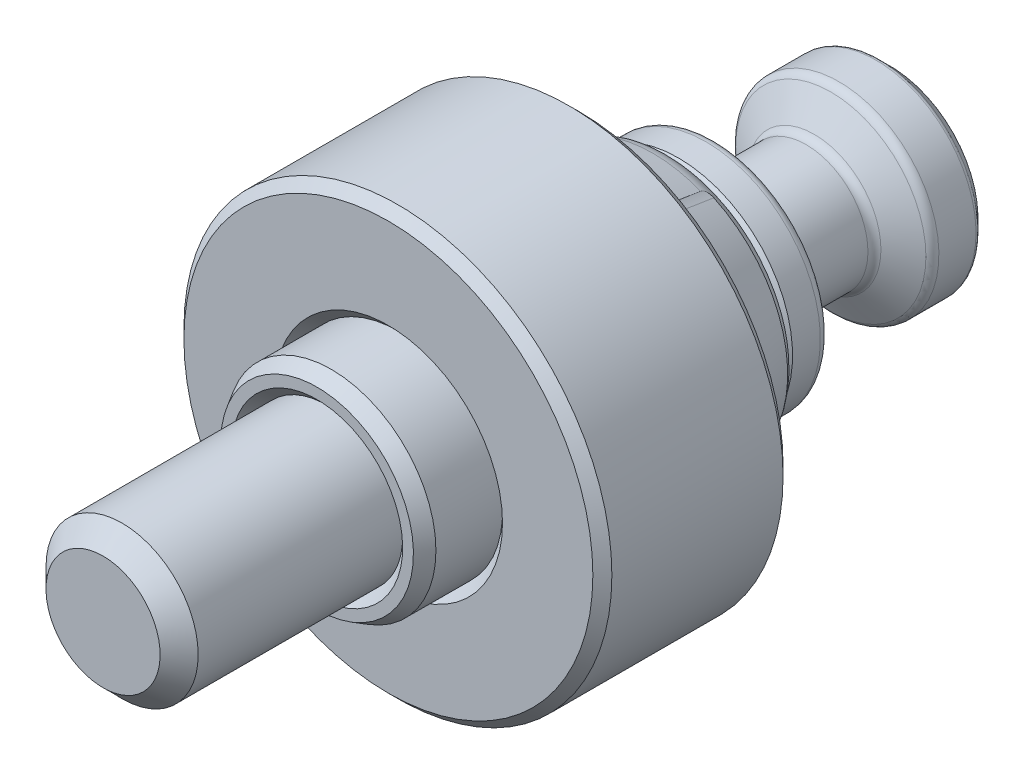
ISO-10303-21;
HEADER;
FILE_DESCRIPTION(('STEP AP214'),'2;1');
FILE_NAME('part.step','',(''),(''),'','','');
FILE_SCHEMA(('AUTOMOTIVE_DESIGN { 1 0 10303 214 1 1 1 1 }'));
ENDSEC;
DATA;
#1=APPLICATION_CONTEXT('core data for automotive mechanical design processes');
#2=APPLICATION_PROTOCOL_DEFINITION('international standard','automotive_design',2000,#1);
#3=PRODUCT_CONTEXT('',#1,'mechanical');
#4=PRODUCT('Part','Part','',(#3));
#5=PRODUCT_RELATED_PRODUCT_CATEGORY('part','',(#4));
#6=PRODUCT_DEFINITION_FORMATION('','',#4);
#7=PRODUCT_DEFINITION_CONTEXT('part definition',#1,'design');
#8=PRODUCT_DEFINITION('design','',#6,#7);
#9=PRODUCT_DEFINITION_SHAPE('','',#8);
#10=(LENGTH_UNIT() NAMED_UNIT(*) SI_UNIT(.MILLI.,.METRE.));
#11=(NAMED_UNIT(*) PLANE_ANGLE_UNIT() SI_UNIT($,.RADIAN.));
#12=(NAMED_UNIT(*) SI_UNIT($,.STERADIAN.) SOLID_ANGLE_UNIT());
#13=UNCERTAINTY_MEASURE_WITH_UNIT(LENGTH_MEASURE(1.E-05),#10,'distance_accuracy_value','');
#14=(GEOMETRIC_REPRESENTATION_CONTEXT(3) GLOBAL_UNCERTAINTY_ASSIGNED_CONTEXT((#13)) GLOBAL_UNIT_ASSIGNED_CONTEXT((#10,
#11,#12)) REPRESENTATION_CONTEXT('',''));
#15=CARTESIAN_POINT('',(0.,0.,0.));
#16=DIRECTION('',(0.,0.,1.));
#17=DIRECTION('',(1.,0.,0.));
#18=AXIS2_PLACEMENT_3D('',#15,#16,#17);
#19=CARTESIAN_POINT('',(0.,0.,20.));
#20=DIRECTION('',(0.,0.,1.));
#21=DIRECTION('',(-1.,0.,0.));
#22=AXIS2_PLACEMENT_3D('',#19,#20,#21);
#23=CONICAL_SURFACE('',#22,12.,0.785398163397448);
#24=CARTESIAN_POINT('',(0.,0.,19.));
#25=DIRECTION('',(0.,0.,1.));
#26=DIRECTION('',(-1.,0.,0.));
#27=AXIS2_PLACEMENT_3D('',#24,#25,#26);
#28=CIRCLE('',#27,11.);
#29=CARTESIAN_POINT('',(-11.,0.,19.));
#30=VERTEX_POINT('',#29);
#31=EDGE_CURVE('E563',#30,#30,#28,.T.);
#32=ORIENTED_EDGE('',*,*,#31,.F.);
#33=EDGE_LOOP('',(#32));
#34=FACE_BOUND('',#33,.T.);
#35=CARTESIAN_POINT('',(0.,0.,20.));
#36=DIRECTION('',(0.,0.,1.));
#37=DIRECTION('',(-1.,0.,0.));
#38=AXIS2_PLACEMENT_3D('',#35,#36,#37);
#39=CIRCLE('',#38,12.);
#40=CARTESIAN_POINT('',(-12.,0.,20.));
#41=VERTEX_POINT('',#40);
#42=EDGE_CURVE('E556',#41,#41,#39,.F.);
#43=ORIENTED_EDGE('',*,*,#42,.F.);
#44=EDGE_LOOP('',(#43));
#45=FACE_BOUND('',#44,.T.);
#46=ADVANCED_FACE('F15',(#34,#45),#23,.F.);
#47=CARTESIAN_POINT('',(11.0000000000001,0.,20.));
#48=DIRECTION('',(0.,0.,1.));
#49=DIRECTION('',(-1.,0.,0.));
#50=AXIS2_PLACEMENT_3D('',#47,#48,#49);
#51=PLANE('',#50);
#52=ORIENTED_EDGE('',*,*,#42,.T.);
#53=EDGE_LOOP('',(#52));
#54=FACE_BOUND('',#53,.T.);
#55=CARTESIAN_POINT('',(0.,0.,20.));
#56=DIRECTION('',(0.,0.,1.));
#57=DIRECTION('',(-1.,0.,0.));
#58=AXIS2_PLACEMENT_3D('',#55,#56,#57);
#59=CIRCLE('',#58,21.5);
#60=CARTESIAN_POINT('',(-21.5,0.,20.));
#61=VERTEX_POINT('',#60);
#62=EDGE_CURVE('E569',#61,#61,#59,.T.);
#63=ORIENTED_EDGE('',*,*,#62,.T.);
#64=EDGE_LOOP('',(#63));
#65=FACE_BOUND('',#64,.T.);
#66=ADVANCED_FACE('F527',(#54,#65),#51,.T.);
#67=CARTESIAN_POINT('',(0.,0.,19.));
#68=DIRECTION('',(0.,0.,-1.));
#69=DIRECTION('',(1.,0.,0.));
#70=AXIS2_PLACEMENT_3D('',#67,#68,#69);
#71=CONICAL_SURFACE('',#70,22.5,0.78539816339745);
#72=ORIENTED_EDGE('',*,*,#62,.F.);
#73=EDGE_LOOP('',(#72));
#74=FACE_BOUND('',#73,.T.);
#75=CARTESIAN_POINT('',(0.,0.,19.));
#76=DIRECTION('',(0.,0.,1.));
#77=DIRECTION('',(-1.,0.,0.));
#78=AXIS2_PLACEMENT_3D('',#75,#76,#77);
#79=CIRCLE('',#78,22.5);
#80=CARTESIAN_POINT('',(-22.5,0.,19.));
#81=VERTEX_POINT('',#80);
#82=EDGE_CURVE('E572',#81,#81,#79,.F.);
#83=ORIENTED_EDGE('',*,*,#82,.F.);
#84=EDGE_LOOP('',(#83));
#85=FACE_BOUND('',#84,.T.);
#86=ADVANCED_FACE('F534',(#74,#85),#71,.T.);
#87=CARTESIAN_POINT('',(22.5,0.,-1.19379064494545E-13));
#88=DIRECTION('',(0.,0.,-1.));
#89=DIRECTION('',(1.,0.,0.));
#90=AXIS2_PLACEMENT_3D('',#87,#88,#89);
#91=PLANE('',#90);
#92=CARTESIAN_POINT('',(0.,0.,-1.19370659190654E-13));
#93=DIRECTION('',(0.,0.,-1.));
#94=DIRECTION('',(-1.,0.,0.));
#95=AXIS2_PLACEMENT_3D('',#92,#93,#94);
#96=CIRCLE('',#95,15.55);
#97=CARTESIAN_POINT('',(-15.55,0.,-1.19370659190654E-13));
#98=VERTEX_POINT('',#97);
#99=EDGE_CURVE('E9',#98,#98,#96,.T.);
#100=ORIENTED_EDGE('',*,*,#99,.F.);
#101=EDGE_LOOP('',(#100));
#102=FACE_BOUND('',#101,.T.);
#103=CARTESIAN_POINT('',(0.,0.,-1.19379064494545E-13));
#104=DIRECTION('',(0.,0.,-1.));
#105=DIRECTION('',(1.,0.,0.));
#106=AXIS2_PLACEMENT_3D('',#103,#104,#105);
#107=CIRCLE('',#106,21.5);
#108=CARTESIAN_POINT('',(21.5,0.,-1.19379064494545E-13));
#109=VERTEX_POINT('',#108);
#110=EDGE_CURVE('E566',#109,#109,#107,.T.);
#111=ORIENTED_EDGE('',*,*,#110,.T.);
#112=EDGE_LOOP('',(#111));
#113=FACE_BOUND('',#112,.T.);
#114=ADVANCED_FACE('F581',(#102,#113),#91,.T.);
#115=CARTESIAN_POINT('',(0.,0.,-1.19379064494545E-13));
#116=DIRECTION('',(0.,0.,1.));
#117=DIRECTION('',(-1.,0.,0.));
#118=AXIS2_PLACEMENT_3D('',#115,#116,#117);
#119=CONICAL_SURFACE('',#118,21.5,0.785398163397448);
#120=CARTESIAN_POINT('',(0.,0.,0.999999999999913));
#121=DIRECTION('',(0.,0.,-1.));
#122=DIRECTION('',(1.,0.,0.));
#123=AXIS2_PLACEMENT_3D('',#120,#121,#122);
#124=CIRCLE('',#123,22.5);
#125=CARTESIAN_POINT('',(22.5,0.,0.999999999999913));
#126=VERTEX_POINT('',#125);
#127=EDGE_CURVE('E174',#126,#126,#124,.F.);
#128=ORIENTED_EDGE('',*,*,#127,.F.);
#129=EDGE_LOOP('',(#128));
#130=FACE_BOUND('',#129,.T.);
#131=ORIENTED_EDGE('',*,*,#110,.F.);
#132=EDGE_LOOP('',(#131));
#133=FACE_BOUND('',#132,.T.);
#134=ADVANCED_FACE('F522',(#130,#133),#119,.T.);
#135=CARTESIAN_POINT('',(0.,0.,0.));
#136=DIRECTION('',(0.,0.,-1.));
#137=DIRECTION('',(1.,0.,0.));
#138=AXIS2_PLACEMENT_3D('',#135,#136,#137);
#139=CYLINDRICAL_SURFACE('',#138,22.5);
#140=ORIENTED_EDGE('',*,*,#82,.T.);
#141=EDGE_LOOP('',(#140));
#142=FACE_BOUND('',#141,.T.);
#143=ORIENTED_EDGE('',*,*,#127,.T.);
#144=EDGE_LOOP('',(#143));
#145=FACE_BOUND('',#144,.T.);
#146=ADVANCED_FACE('F514',(#142,#145),#139,.T.);
#147=CARTESIAN_POINT('',(0.,0.,-0.199999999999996));
#148=DIRECTION('',(0.,0.,-1.));
#149=DIRECTION('',(0.,1.,0.));
#150=AXIS2_PLACEMENT_3D('',#147,#148,#149);
#151=CONICAL_SURFACE('',#150,15.75,0.785398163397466);
#152=ORIENTED_EDGE('',*,*,#99,.T.);
#153=EDGE_LOOP('',(#152));
#154=FACE_BOUND('',#153,.T.);
#155=CARTESIAN_POINT('',(0.,0.,-0.199999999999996));
#156=DIRECTION('',(0.,0.,1.));
#157=DIRECTION('',(0.,-1.,0.));
#158=AXIS2_PLACEMENT_3D('',#155,#156,#157);
#159=CIRCLE('',#158,15.75);
#160=CARTESIAN_POINT('',(0.,-15.75,-0.199999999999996));
#161=VERTEX_POINT('',#160);
#162=EDGE_CURVE('E167',#161,#161,#159,.F.);
#163=ORIENTED_EDGE('',*,*,#162,.F.);
#164=EDGE_LOOP('',(#163));
#165=FACE_BOUND('',#164,.T.);
#166=ADVANCED_FACE('F206',(#154,#165),#151,.T.);
#167=CARTESIAN_POINT('',(0.,0.,0.));
#168=DIRECTION('',(0.,0.,-1.));
#169=DIRECTION('',(0.,1.,0.));
#170=AXIS2_PLACEMENT_3D('',#167,#168,#169);
#171=CYLINDRICAL_SURFACE('',#170,15.75);
#172=ORIENTED_EDGE('',*,*,#162,.T.);
#173=EDGE_LOOP('',(#172));
#174=FACE_BOUND('',#173,.T.);
#175=CARTESIAN_POINT('',(0.,0.,-0.871853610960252));
#176=DIRECTION('',(0.,0.,-1.));
#177=DIRECTION('',(0.,1.,0.));
#178=AXIS2_PLACEMENT_3D('',#175,#176,#177);
#179=CIRCLE('',#178,15.75);
#180=CARTESIAN_POINT('',(-5.85511231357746,14.6212229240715,-0.871853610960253));
#181=VERTEX_POINT('',#180);
#182=CARTESIAN_POINT('',(5.85511231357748,14.6212229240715,-0.871853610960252));
#183=VERTEX_POINT('',#182);
#184=EDGE_CURVE('E143',#181,#183,#179,.T.);
#185=ORIENTED_EDGE('',*,*,#184,.F.);
#186=CARTESIAN_POINT('',(-5.85511231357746,14.6212229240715,-0.871853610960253));
#187=CARTESIAN_POINT('',(-5.9075302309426,14.6002278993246,-0.824740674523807));
#188=CARTESIAN_POINT('',(-5.96213135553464,14.5780392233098,-0.780134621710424));
#189=CARTESIAN_POINT('',(-6.07657679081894,14.5307138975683,-0.697914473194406));
#190=CARTESIAN_POINT('',(-6.13648968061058,14.505536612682,-0.660420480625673));
#191=CARTESIAN_POINT('',(-6.26131221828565,14.4520963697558,-0.595775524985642));
#192=CARTESIAN_POINT('',(-6.32625908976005,14.4238096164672,-0.568712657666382));
#193=CARTESIAN_POINT('',(-6.45895951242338,14.3648719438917,-0.528902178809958));
#194=CARTESIAN_POINT('',(-6.52668971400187,14.3342393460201,-0.516053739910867));
#195=CARTESIAN_POINT('',(-6.65533625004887,14.2749244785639,-0.506942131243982));
#196=CARTESIAN_POINT('',(-6.71620304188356,14.2463861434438,-0.509045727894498));
#197=CARTESIAN_POINT('',(-6.83625337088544,14.1891712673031,-0.525737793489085));
#198=CARTESIAN_POINT('',(-6.89543248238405,14.1604945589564,-0.540356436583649));
#199=CARTESIAN_POINT('',(-7.02087629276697,14.0987780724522,-0.583964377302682));
#200=CARTESIAN_POINT('',(-7.08646010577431,14.0658983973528,-0.615091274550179));
#201=CARTESIAN_POINT('',(-7.21193972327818,14.0019793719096,-0.688488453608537));
#202=CARTESIAN_POINT('',(-7.27182691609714,13.9709428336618,-0.730775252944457));
#203=CARTESIAN_POINT('',(-7.3660953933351,13.9213817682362,-0.807113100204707));
#204=CARTESIAN_POINT('',(-7.40205963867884,13.9022844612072,-0.838856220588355));
#205=CARTESIAN_POINT('',(-7.436912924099,13.8836171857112,-0.871853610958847));
#206=B_SPLINE_CURVE_WITH_KNOTS('',3,(#186,#187,#188,#189,#190,#191,#192,#193,#194,#195,#196,
#197,#198,#199,#200,#201,#202,#203,#204,#205),.UNSPECIFIED.,.F.,.F.,(4,2,2,2,2,2,2,2,2,4),(0.,
0.22098158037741,0.445415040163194,0.671704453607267,0.896378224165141,1.09691911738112,
1.29794488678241,1.53569897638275,1.77380695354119,1.92846237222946),.UNSPECIFIED.);
#207=CARTESIAN_POINT('',(-6.65623762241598,14.2743476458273,-0.509058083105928));
#208=VERTEX_POINT('',#207);
#209=EDGE_CURVE('E471',#181,#208,#206,.T.);
#210=ORIENTED_EDGE('',*,*,#209,.T.);
#211=CARTESIAN_POINT('',(0.,0.,-0.509058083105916));
#212=DIRECTION('',(0.,0.,1.));
#213=DIRECTION('',(0.,-1.,0.));
#214=AXIS2_PLACEMENT_3D('',#211,#212,#213);
#215=CIRCLE('',#214,15.75);
#216=CARTESIAN_POINT('',(-6.65623762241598,-14.2743476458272,-0.50905808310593));
#217=VERTEX_POINT('',#216);
#218=EDGE_CURVE('E491',#208,#217,#215,.T.);
#219=ORIENTED_EDGE('',*,*,#218,.T.);
#220=CARTESIAN_POINT('',(-7.43691292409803,-13.8836171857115,-0.871853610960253));
#221=CARTESIAN_POINT('',(-7.38713621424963,-13.9102762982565,-0.8247406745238));
#222=CARTESIAN_POINT('',(-7.3350417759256,-13.9378405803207,-0.780134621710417));
#223=CARTESIAN_POINT('',(-7.22522436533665,-13.9950907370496,-0.697914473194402));
#224=CARTESIAN_POINT('',(-7.16742618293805,-14.0248030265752,-0.660420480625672));
#225=CARTESIAN_POINT('',(-7.04625420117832,-14.0860719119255,-0.595775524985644));
#226=CARTESIAN_POINT('',(-6.98283824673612,-14.1176417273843,-0.568712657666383));
#227=CARTESIAN_POINT('',(-6.85239118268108,-14.1814117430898,-0.52890217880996));
#228=CARTESIAN_POINT('',(-6.78538911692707,-14.213605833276,-0.516053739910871));
#229=CARTESIAN_POINT('',(-6.65725889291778,-14.2740279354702,-0.506942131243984));
#230=CARTESIAN_POINT('',(-6.59627284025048,-14.3023105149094,-0.509045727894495));
#231=CARTESIAN_POINT('',(-6.47527683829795,-14.3574973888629,-0.525737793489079));
#232=CARTESIAN_POINT('',(-6.41526960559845,-14.3843981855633,-0.540356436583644));
#233=CARTESIAN_POINT('',(-6.28735830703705,-14.4408231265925,-0.583964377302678));
#234=CARTESIAN_POINT('',(-6.22001455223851,-14.4699285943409,-0.615091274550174));
#235=CARTESIAN_POINT('',(-6.09039299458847,-14.5249652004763,-0.688488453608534));
#236=CARTESIAN_POINT('',(-6.02812288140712,-14.550891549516,-0.730775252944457));
#237=CARTESIAN_POINT('',(-5.92956229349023,-14.591248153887,-0.807113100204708));
#238=CARTESIAN_POINT('',(-5.89181553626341,-14.6065228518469,-0.838856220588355));
#239=CARTESIAN_POINT('',(-5.85511231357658,-14.621222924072,-0.871853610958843));
#240=B_SPLINE_CURVE_WITH_KNOTS('',3,(#220,#221,#222,#223,#224,#225,#226,#227,#228,#229,#230,
#231,#232,#233,#234,#235,#236,#237,#238,#239),.UNSPECIFIED.,.F.,.F.,(4,2,2,2,2,2,2,2,2,4),(0.,
0.220981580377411,0.445415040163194,0.671704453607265,0.896378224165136,1.09691911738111,
1.2979448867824,1.53569897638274,1.77380695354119,1.92846237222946),.UNSPECIFIED.);
#241=CARTESIAN_POINT('',(-5.85511231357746,-14.6212229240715,-0.871853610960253));
#242=VERTEX_POINT('',#241);
#243=EDGE_CURVE('E322',#217,#242,#240,.T.);
#244=ORIENTED_EDGE('',*,*,#243,.T.);
#245=CARTESIAN_POINT('',(5.85511231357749,-14.6212229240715,-0.871853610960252));
#246=VERTEX_POINT('',#245);
#247=EDGE_CURVE('E402',#246,#242,#179,.T.);
#248=ORIENTED_EDGE('',*,*,#247,.F.);
#249=CARTESIAN_POINT('',(5.85511231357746,-14.6212229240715,-0.871853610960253));
#250=CARTESIAN_POINT('',(5.9075302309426,-14.6002278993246,-0.824740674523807));
#251=CARTESIAN_POINT('',(5.96213135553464,-14.5780392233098,-0.780134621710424));
#252=CARTESIAN_POINT('',(6.07657679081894,-14.5307138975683,-0.697914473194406));
#253=CARTESIAN_POINT('',(6.13648968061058,-14.505536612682,-0.660420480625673));
#254=CARTESIAN_POINT('',(6.26131221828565,-14.4520963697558,-0.595775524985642));
#255=CARTESIAN_POINT('',(6.32625908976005,-14.4238096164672,-0.568712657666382));
#256=CARTESIAN_POINT('',(6.45895951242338,-14.3648719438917,-0.528902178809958));
#257=CARTESIAN_POINT('',(6.52668971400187,-14.3342393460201,-0.516053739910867));
#258=CARTESIAN_POINT('',(6.65533625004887,-14.2749244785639,-0.506942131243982));
#259=CARTESIAN_POINT('',(6.71620304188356,-14.2463861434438,-0.509045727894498));
#260=CARTESIAN_POINT('',(6.83625337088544,-14.1891712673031,-0.525737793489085));
#261=CARTESIAN_POINT('',(6.89543248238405,-14.1604945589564,-0.540356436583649));
#262=CARTESIAN_POINT('',(7.02087629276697,-14.0987780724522,-0.583964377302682));
#263=CARTESIAN_POINT('',(7.08646010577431,-14.0658983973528,-0.615091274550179));
#264=CARTESIAN_POINT('',(7.21193972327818,-14.0019793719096,-0.688488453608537));
#265=CARTESIAN_POINT('',(7.27182691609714,-13.9709428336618,-0.730775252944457));
#266=CARTESIAN_POINT('',(7.3660953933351,-13.9213817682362,-0.807113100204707));
#267=CARTESIAN_POINT('',(7.40205963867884,-13.9022844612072,-0.838856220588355));
#268=CARTESIAN_POINT('',(7.436912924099,-13.8836171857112,-0.871853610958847));
#269=B_SPLINE_CURVE_WITH_KNOTS('',3,(#249,#250,#251,#252,#253,#254,#255,#256,#257,#258,#259,
#260,#261,#262,#263,#264,#265,#266,#267,#268),.UNSPECIFIED.,.F.,.F.,(4,2,2,2,2,2,2,2,2,4),(0.,
0.22098158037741,0.445415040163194,0.671704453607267,0.896378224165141,1.09691911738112,
1.29794488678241,1.53569897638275,1.77380695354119,1.92846237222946),.UNSPECIFIED.);
#270=CARTESIAN_POINT('',(6.65623762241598,-14.2743476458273,-0.509058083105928));
#271=VERTEX_POINT('',#270);
#272=EDGE_CURVE('E379',#246,#271,#269,.T.);
#273=ORIENTED_EDGE('',*,*,#272,.T.);
#274=CARTESIAN_POINT('',(0.,0.,-0.509058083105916));
#275=DIRECTION('',(0.,0.,1.));
#276=DIRECTION('',(0.,-1.,0.));
#277=AXIS2_PLACEMENT_3D('',#274,#275,#276);
#278=CIRCLE('',#277,15.75);
#279=CARTESIAN_POINT('',(6.65623762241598,14.2743476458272,-0.50905808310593));
#280=VERTEX_POINT('',#279);
#281=EDGE_CURVE('E400',#280,#271,#278,.F.);
#282=ORIENTED_EDGE('',*,*,#281,.F.);
#283=CARTESIAN_POINT('',(7.43691292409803,13.8836171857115,-0.871853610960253));
#284=CARTESIAN_POINT('',(7.38713621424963,13.9102762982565,-0.8247406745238));
#285=CARTESIAN_POINT('',(7.3350417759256,13.9378405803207,-0.780134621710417));
#286=CARTESIAN_POINT('',(7.22522436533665,13.9950907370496,-0.697914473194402));
#287=CARTESIAN_POINT('',(7.16742618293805,14.0248030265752,-0.660420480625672));
#288=CARTESIAN_POINT('',(7.04625420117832,14.0860719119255,-0.595775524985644));
#289=CARTESIAN_POINT('',(6.98283824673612,14.1176417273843,-0.568712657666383));
#290=CARTESIAN_POINT('',(6.85239118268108,14.1814117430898,-0.52890217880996));
#291=CARTESIAN_POINT('',(6.78538911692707,14.213605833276,-0.516053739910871));
#292=CARTESIAN_POINT('',(6.65725889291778,14.2740279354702,-0.506942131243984));
#293=CARTESIAN_POINT('',(6.59627284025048,14.3023105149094,-0.509045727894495));
#294=CARTESIAN_POINT('',(6.47527683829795,14.3574973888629,-0.525737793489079));
#295=CARTESIAN_POINT('',(6.41526960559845,14.3843981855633,-0.540356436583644));
#296=CARTESIAN_POINT('',(6.28735830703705,14.4408231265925,-0.583964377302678));
#297=CARTESIAN_POINT('',(6.22001455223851,14.4699285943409,-0.615091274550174));
#298=CARTESIAN_POINT('',(6.09039299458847,14.5249652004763,-0.688488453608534));
#299=CARTESIAN_POINT('',(6.02812288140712,14.550891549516,-0.730775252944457));
#300=CARTESIAN_POINT('',(5.92956229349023,14.591248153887,-0.807113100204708));
#301=CARTESIAN_POINT('',(5.89181553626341,14.6065228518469,-0.838856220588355));
#302=CARTESIAN_POINT('',(5.85511231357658,14.621222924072,-0.871853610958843));
#303=B_SPLINE_CURVE_WITH_KNOTS('',3,(#283,#284,#285,#286,#287,#288,#289,#290,#291,#292,#293,
#294,#295,#296,#297,#298,#299,#300,#301,#302),.UNSPECIFIED.,.F.,.F.,(4,2,2,2,2,2,2,2,2,4),(0.,
0.220981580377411,0.445415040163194,0.671704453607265,0.896378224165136,1.09691911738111,
1.2979448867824,1.53569897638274,1.77380695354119,1.92846237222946),.UNSPECIFIED.);
#304=EDGE_CURVE('E35',#280,#183,#303,.T.);
#305=ORIENTED_EDGE('',*,*,#304,.T.);
#306=EDGE_LOOP('',(#185,#210,#219,#244,#248,#273,#282,#305));
#307=FACE_BOUND('',#306,.T.);
#308=ADVANCED_FACE('F343',(#174,#307),#171,.T.);
#309=CARTESIAN_POINT('',(0.,0.,-10.));
#310=DIRECTION('',(0.,0.,1.));
#311=DIRECTION('',(0.,-1.,0.));
#312=AXIS2_PLACEMENT_3D('',#309,#310,#311);
#313=CONICAL_SURFACE('',#312,13.132546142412,0.279252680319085);
#314=CARTESIAN_POINT('',(0.,0.,-7.82691206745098));
#315=DIRECTION('',(0.,0.,-1.));
#316=DIRECTION('',(0.,1.,0.));
#317=AXIS2_PLACEMENT_3D('',#314,#315,#316);
#318=CIRCLE('',#317,13.7556690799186);
#319=CARTESIAN_POINT('',(5.02412093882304,12.805336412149,-7.82691206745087));
#320=VERTEX_POINT('',#319);
#321=CARTESIAN_POINT('',(-5.02412093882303,12.8053364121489,-7.82691206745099));
#322=VERTEX_POINT('',#321);
#323=EDGE_CURVE('E141',#320,#322,#318,.F.);
#324=ORIENTED_EDGE('',*,*,#323,.T.);
#325=CARTESIAN_POINT('',(-5.02409708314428,12.8052841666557,-7.82711206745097));
#326=CARTESIAN_POINT('',(-5.16238139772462,13.1080982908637,-6.66788133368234));
#327=CARTESIAN_POINT('',(-5.30077681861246,13.4108379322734,-5.50864442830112));
#328=CARTESIAN_POINT('',(-5.57778987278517,14.0161682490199,-3.19015827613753));
#329=CARTESIAN_POINT('',(-5.71640750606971,14.318758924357,-2.03090902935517));
#330=CARTESIAN_POINT('',(-5.85513624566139,14.6212751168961,-0.871653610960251));
#331=B_SPLINE_CURVE_WITH_KNOTS('',3,(#325,#326,#327,#328,#329,#330),.UNSPECIFIED.,.F.,.F.,(4,2,
4),(0.,3.61824723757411,7.2364944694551),.UNSPECIFIED.);
#332=EDGE_CURVE('E323',#322,#181,#331,.T.);
#333=ORIENTED_EDGE('',*,*,#332,.T.);
#334=ORIENTED_EDGE('',*,*,#184,.T.);
#335=CARTESIAN_POINT('',(5.85513624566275,14.6212751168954,-0.871653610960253));
#336=CARTESIAN_POINT('',(5.71640750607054,14.3187589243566,-2.03090902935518));
#337=CARTESIAN_POINT('',(5.57778987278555,14.0161682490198,-3.19015827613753));
#338=CARTESIAN_POINT('',(5.30077681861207,13.4108379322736,-5.50864442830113));
#339=CARTESIAN_POINT('',(5.16238139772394,13.108098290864,-6.66788133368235));
#340=CARTESIAN_POINT('',(5.02409708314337,12.8052841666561,-7.82711206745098));
#341=B_SPLINE_CURVE_WITH_KNOTS('',3,(#335,#336,#337,#338,#339,#340),.UNSPECIFIED.,.F.,.F.,(4,2,
4),(0.,3.61824723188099,7.2364944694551),.UNSPECIFIED.);
#342=EDGE_CURVE('E129',#183,#320,#341,.T.);
#343=ORIENTED_EDGE('',*,*,#342,.T.);
#344=EDGE_LOOP('',(#324,#333,#334,#343));
#345=FACE_BOUND('',#344,.T.);
#346=ADVANCED_FACE('F139',(#345),#313,.T.);
#347=CARTESIAN_POINT('',(-6.84926759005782,14.6883017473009,-17.0559655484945));
#348=DIRECTION('',(0.116489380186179,-0.249812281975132,-0.961261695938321));
#349=DIRECTION('',(0.,0.967850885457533,-0.251524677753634));
#350=AXIS2_PLACEMENT_3D('',#347,#348,#349);
#351=CYLINDRICAL_SURFACE('',#350,5.);
#352=CARTESIAN_POINT('',(-6.58003876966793,12.0798633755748,-7.82671206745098));
#353=CARTESIAN_POINT('',(-6.57502670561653,12.0691465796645,-7.86803060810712));
#354=CARTESIAN_POINT('',(-6.56601903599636,12.0595133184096,-7.90909915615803));
#355=CARTESIAN_POINT('',(-6.54071964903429,12.0427995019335,-7.98929282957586));
#356=CARTESIAN_POINT('',(-6.52445722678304,12.0357088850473,-8.02842507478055));
#357=CARTESIAN_POINT('',(-6.48530803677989,12.0243755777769,-8.1036476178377));
#358=CARTESIAN_POINT('',(-6.46242236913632,12.0201324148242,-8.13973841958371));
#359=CARTESIAN_POINT('',(-6.41106446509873,12.0147383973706,-8.20795248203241));
#360=CARTESIAN_POINT('',(-6.38259035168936,12.0135885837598,-8.24007440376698));
#361=CARTESIAN_POINT('',(-6.32243234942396,12.0145022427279,-8.29853008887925));
#362=CARTESIAN_POINT('',(-6.2909171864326,12.0164420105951,-8.3250408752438));
#363=CARTESIAN_POINT('',(-6.22486037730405,12.0233268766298,-8.37349191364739));
#364=CARTESIAN_POINT('',(-6.19031805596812,12.0282726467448,-8.39543114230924));
#365=CARTESIAN_POINT('',(-6.11541870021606,12.0417953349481,-8.43668034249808));
#366=CARTESIAN_POINT('',(-6.07483309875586,12.0507010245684,-8.45546667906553));
#367=CARTESIAN_POINT('',(-5.99233134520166,12.0719557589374,-8.48727477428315));
#368=CARTESIAN_POINT('',(-5.95041457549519,12.0843064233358,-8.50029381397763));
#369=CARTESIAN_POINT('',(-5.86144645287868,12.1138203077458,-8.52178240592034));
#370=CARTESIAN_POINT('',(-5.81435649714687,12.1313725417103,-8.52956075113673));
#371=CARTESIAN_POINT('',(-5.72101000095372,12.1700637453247,-8.53809220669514));
#372=CARTESIAN_POINT('',(-5.67475390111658,12.1912045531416,-8.53884170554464));
#373=CARTESIAN_POINT('',(-5.58088256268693,12.2382311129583,-8.53311343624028));
#374=CARTESIAN_POINT('',(-5.53341544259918,12.2643508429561,-8.5261029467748));
#375=CARTESIAN_POINT('',(-5.44209696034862,12.3193439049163,-8.50390425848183));
#376=CARTESIAN_POINT('',(-5.39824607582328,12.3482175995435,-8.48871498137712));
#377=CARTESIAN_POINT('',(-5.31632397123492,12.4071253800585,-8.45040090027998));
#378=CARTESIAN_POINT('',(-5.27816401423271,12.4371297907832,-8.42742166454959));
#379=CARTESIAN_POINT('',(-5.20818682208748,12.4974209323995,-8.37352455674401));
#380=CARTESIAN_POINT('',(-5.17636395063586,12.5277073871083,-8.34261379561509));
#381=CARTESIAN_POINT('',(-5.12345321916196,12.5837878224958,-8.27693620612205));
#382=CARTESIAN_POINT('',(-5.10158942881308,12.6097197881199,-8.24291403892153));
#383=CARTESIAN_POINT('',(-5.06507997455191,12.6591195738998,-8.16957804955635));
#384=CARTESIAN_POINT('',(-5.05043128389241,12.6825884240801,-8.13026645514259));
#385=CARTESIAN_POINT('',(-5.0303601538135,12.7231084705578,-8.05258211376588));
#386=CARTESIAN_POINT('',(-5.02404109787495,12.7405918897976,-8.01466339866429));
#387=CARTESIAN_POINT('',(-5.01781312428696,12.7717906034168,-7.93687925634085));
#388=CARTESIAN_POINT('',(-5.01788640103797,12.7855162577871,-7.89701954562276));
#389=CARTESIAN_POINT('',(-5.02193342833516,12.8000008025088,-7.84682902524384));
#390=CARTESIAN_POINT('',(-5.02294041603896,12.8027637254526,-7.83677405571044));
#391=CARTESIAN_POINT('',(-5.02414482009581,12.8053886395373,-7.82671206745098));
#392=B_SPLINE_CURVE_WITH_KNOTS('',3,(#352,#353,#354,#355,#356,#357,#358,#359,#360,#361,#362,
#363,#364,#365,#366,#367,#368,#369,#370,#371,#372,#373,#374,#375,#376,#377,#378,#379,#380,#381,
#382,#383,#384,#385,#386,#387,#388,#389,#390,#391),.UNSPECIFIED.,.F.,.F.,(4,2,2,2,2,2,2,2,2,2,2,
2,2,2,2,2,2,2,2,4),(0.,0.128684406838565,0.256853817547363,0.385001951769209,0.513193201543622,
0.636379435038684,0.759593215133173,0.895840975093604,1.03215290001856,1.18406544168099,
1.33605603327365,1.49916548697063,1.66229645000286,1.82253324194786,1.98262687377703,
2.12592641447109,2.26916578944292,2.39520621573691,2.52089557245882,2.55231197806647),.UNSPECIFIED.);
#393=CARTESIAN_POINT('',(-5.68329509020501,12.1878656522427,-8.53770745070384));
#394=VERTEX_POINT('',#393);
#395=EDGE_CURVE('E148',#394,#322,#392,.T.);
#396=ORIENTED_EDGE('',*,*,#395,.F.);
#397=DIRECTION('',(0.116489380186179,-0.249812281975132,-0.961261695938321));
#398=VECTOR('',#397,1.);
#399=CARTESIAN_POINT('',(-5.50608886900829,11.807845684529,-10.));
#400=LINE('',#399,#398);
#401=EDGE_CURVE('E90',#208,#394,#400,.T.);
#402=ORIENTED_EDGE('',*,*,#401,.F.);
#403=ORIENTED_EDGE('',*,*,#209,.F.);
#404=ORIENTED_EDGE('',*,*,#332,.F.);
#405=EDGE_LOOP('',(#396,#402,#403,#404));
#406=FACE_BOUND('',#405,.T.);
#407=ADVANCED_FACE('F344',(#406),#351,.F.);
#408=CARTESIAN_POINT('',(0.,0.,0.));
#409=DIRECTION('',(0.,0.,1.));
#410=DIRECTION('',(0.,-1.,0.));
#411=AXIS2_PLACEMENT_3D('',#408,#409,#410);
#412=CONICAL_SURFACE('',#411,15.8959700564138,0.279252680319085);
#413=ORIENTED_EDGE('',*,*,#401,.T.);
#414=CARTESIAN_POINT('',(0.,0.,-8.53770745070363));
#415=DIRECTION('',(0.,0.,1.));
#416=DIRECTION('',(0.,-1.,0.));
#417=AXIS2_PLACEMENT_3D('',#414,#415,#416);
#418=CIRCLE('',#417,13.447821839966);
#419=CARTESIAN_POINT('',(-5.68329509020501,-12.1878656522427,-8.53770745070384));
#420=VERTEX_POINT('',#419);
#421=EDGE_CURVE('E172',#420,#394,#418,.F.);
#422=ORIENTED_EDGE('',*,*,#421,.F.);
#423=DIRECTION('',(0.116489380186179,0.249812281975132,-0.961261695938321));
#424=VECTOR('',#423,1.);
#425=CARTESIAN_POINT('',(-5.50608886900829,-11.807845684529,-10.));
#426=LINE('',#425,#424);
#427=EDGE_CURVE('E356',#217,#420,#426,.T.);
#428=ORIENTED_EDGE('',*,*,#427,.F.);
#429=ORIENTED_EDGE('',*,*,#218,.F.);
#430=EDGE_LOOP('',(#413,#422,#428,#429));
#431=FACE_BOUND('',#430,.T.);
#432=ADVANCED_FACE('F291',(#431),#412,.T.);
#433=CARTESIAN_POINT('',(-6.84926759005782,-14.6883017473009,-17.0559655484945));
#434=DIRECTION('',(0.116489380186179,0.249812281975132,-0.961261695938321));
#435=DIRECTION('',(0.,-0.967850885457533,-0.251524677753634));
#436=AXIS2_PLACEMENT_3D('',#433,#434,#435);
#437=CYLINDRICAL_SURFACE('',#436,5.);
#438=ORIENTED_EDGE('',*,*,#243,.F.);
#439=ORIENTED_EDGE('',*,*,#427,.T.);
#440=CARTESIAN_POINT('',(-5.02414482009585,-12.8053886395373,-7.82671206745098));
#441=CARTESIAN_POINT('',(-5.01915697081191,-12.7946605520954,-7.86803060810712));
#442=CARTESIAN_POINT('',(-5.01756748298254,-12.781568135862,-7.90909915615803));
#443=CARTESIAN_POINT('',(-5.02102608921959,-12.751444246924,-7.98929282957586));
#444=CARTESIAN_POINT('',(-5.02604764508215,-12.7344287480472,-8.02842507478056));
#445=CARTESIAN_POINT('',(-5.0425304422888,-12.6971538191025,-8.1036476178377));
#446=CARTESIAN_POINT('',(-5.05399061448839,-12.6768949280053,-8.1397384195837));
#447=CARTESIAN_POINT('',(-5.08287078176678,-12.6340852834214,-8.2079524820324));
#448=CARTESIAN_POINT('',(-5.10029278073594,-12.6115337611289,-8.24007440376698));
#449=CARTESIAN_POINT('',(-5.13966150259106,-12.5660373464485,-8.29853008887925));
#450=CARTESIAN_POINT('',(-5.16140500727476,-12.5431421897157,-8.3250408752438));
#451=CARTESIAN_POINT('',(-5.20913961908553,-12.4969652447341,-8.37349191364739));
#452=CARTESIAN_POINT('',(-5.23513167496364,-12.4736833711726,-8.39543114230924));
#453=CARTESIAN_POINT('',(-5.29363503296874,-12.4249993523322,-8.43668034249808));
#454=CARTESIAN_POINT('',(-5.32654510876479,-12.3996334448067,-8.45546667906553));
#455=CARTESIAN_POINT('',(-5.39585828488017,-12.3500957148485,-8.48727477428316));
#456=CARTESIAN_POINT('',(-5.43226302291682,-12.325924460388,-8.50029381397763));
#457=CARTESIAN_POINT('',(-5.51205957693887,-12.2767420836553,-8.52178240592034));
#458=CARTESIAN_POINT('',(-5.55577420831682,-12.251951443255,-8.52956075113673));
#459=CARTESIAN_POINT('',(-5.64541536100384,-12.2053141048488,-8.53809220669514));
#460=CARTESIAN_POINT('',(-5.69134300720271,-12.1834689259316,-8.53884170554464));
#461=CARTESIAN_POINT('',(-5.7877067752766,-12.1417873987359,-8.53311343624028));
#462=CARTESIAN_POINT('',(-5.83822692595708,-12.1222149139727,-8.5261029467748));
#463=CARTESIAN_POINT('',(-5.93905244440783,-12.0876097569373,-8.50390425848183));
#464=CARTESIAN_POINT('',(-5.98935778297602,-12.0725776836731,-8.48871498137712));
#465=CARTESIAN_POINT('',(-6.08714227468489,-12.0476869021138,-8.45040090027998));
#466=CARTESIAN_POINT('',(-6.13465573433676,-12.0377411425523,-8.42742166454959));
#467=CARTESIAN_POINT('',(-6.22582190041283,-12.0228899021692,-8.37352455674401));
#468=CARTESIAN_POINT('',(-6.26947801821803,-12.0179799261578,-8.34261379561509));
#469=CARTESIAN_POINT('',(-6.34644848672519,-12.0134957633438,-8.27693620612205));
#470=CARTESIAN_POINT('',(-6.3803672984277,-12.0134158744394,-8.24291403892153));
#471=CARTESIAN_POINT('',(-6.44167755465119,-12.0172015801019,-8.16957804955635));
#472=CARTESIAN_POINT('',(-6.46907173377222,-12.0210655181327,-8.1302664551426));
#473=CARTESIAN_POINT('',(-6.51301336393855,-12.0317359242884,-8.05258211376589));
#474=CARTESIAN_POINT('',(-6.5304682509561,-12.0381333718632,-8.0146633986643));
#475=CARTESIAN_POINT('',(-6.55837111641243,-12.0534166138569,-7.93687925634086));
#476=CARTESIAN_POINT('',(-6.56883847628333,-12.0622954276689,-7.89701954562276));
#477=CARTESIAN_POINT('',(-6.57733290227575,-12.07470611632,-7.84682902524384));
#478=CARTESIAN_POINT('',(-6.57880214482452,-12.0772534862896,-7.83677405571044));
#479=CARTESIAN_POINT('',(-6.58003876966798,-12.0798633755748,-7.82671206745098));
#480=B_SPLINE_CURVE_WITH_KNOTS('',3,(#440,#441,#442,#443,#444,#445,#446,#447,#448,#449,#450,
#451,#452,#453,#454,#455,#456,#457,#458,#459,#460,#461,#462,#463,#464,#465,#466,#467,#468,#469,
#470,#471,#472,#473,#474,#475,#476,#477,#478,#479),.UNSPECIFIED.,.F.,.F.,(4,2,2,2,2,2,2,2,2,2,2,
2,2,2,2,2,2,2,2,4),(0.,0.128684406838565,0.256853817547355,0.385001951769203,0.513193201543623,
0.636379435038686,0.759593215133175,0.8958409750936,1.03215290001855,1.18406544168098,
1.33605603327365,1.49916548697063,1.66229645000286,1.82253324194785,1.98262687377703,
2.12592641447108,2.26916578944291,2.3952062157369,2.52089557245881,2.55231197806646),.UNSPECIFIED.);
#481=CARTESIAN_POINT('',(-5.02412093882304,-12.805336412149,-7.82691206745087));
#482=VERTEX_POINT('',#481);
#483=EDGE_CURVE('E313',#482,#420,#480,.T.);
#484=ORIENTED_EDGE('',*,*,#483,.F.);
#485=CARTESIAN_POINT('',(-5.85513624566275,-14.6212751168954,-0.871653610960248));
#486=CARTESIAN_POINT('',(-5.71640750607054,-14.3187589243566,-2.03090902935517));
#487=CARTESIAN_POINT('',(-5.57778987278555,-14.0161682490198,-3.19015827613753));
#488=CARTESIAN_POINT('',(-5.30077681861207,-13.4108379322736,-5.50864442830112));
#489=CARTESIAN_POINT('',(-5.16238139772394,-13.108098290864,-6.66788133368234));
#490=CARTESIAN_POINT('',(-5.02409708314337,-12.8052841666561,-7.82711206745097));
#491=B_SPLINE_CURVE_WITH_KNOTS('',3,(#485,#486,#487,#488,#489,#490),.UNSPECIFIED.,.F.,.F.,(4,2,
4),(0.,3.61824723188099,7.2364944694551),.UNSPECIFIED.);
#492=EDGE_CURVE('E349',#242,#482,#491,.T.);
#493=ORIENTED_EDGE('',*,*,#492,.F.);
#494=EDGE_LOOP('',(#438,#439,#484,#493));
#495=FACE_BOUND('',#494,.T.);
#496=ADVANCED_FACE('F337',(#495),#437,.F.);
#497=ORIENTED_EDGE('',*,*,#247,.T.);
#498=ORIENTED_EDGE('',*,*,#492,.T.);
#499=CARTESIAN_POINT('',(5.02412093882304,-12.8053364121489,-7.82691206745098));
#500=VERTEX_POINT('',#499);
#501=EDGE_CURVE('E150',#482,#500,#318,.F.);
#502=ORIENTED_EDGE('',*,*,#501,.T.);
#503=CARTESIAN_POINT('',(5.02409708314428,-12.8052841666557,-7.82711206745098));
#504=CARTESIAN_POINT('',(5.16238139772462,-13.1080982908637,-6.66788133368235));
#505=CARTESIAN_POINT('',(5.30077681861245,-13.4108379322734,-5.50864442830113));
#506=CARTESIAN_POINT('',(5.57778987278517,-14.0161682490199,-3.19015827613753));
#507=CARTESIAN_POINT('',(5.71640750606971,-14.318758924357,-2.03090902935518));
#508=CARTESIAN_POINT('',(5.8551362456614,-14.6212751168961,-0.871653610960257));
#509=B_SPLINE_CURVE_WITH_KNOTS('',3,(#503,#504,#505,#506,#507,#508),.UNSPECIFIED.,.F.,.F.,(4,2,
4),(0.,3.61824723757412,7.2364944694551),.UNSPECIFIED.);
#510=EDGE_CURVE('E372',#500,#246,#509,.T.);
#511=ORIENTED_EDGE('',*,*,#510,.T.);
#512=EDGE_LOOP('',(#497,#498,#502,#511));
#513=FACE_BOUND('',#512,.T.);
#514=ADVANCED_FACE('F341',(#513),#313,.T.);
#515=CARTESIAN_POINT('',(6.84926759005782,-14.6883017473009,-17.0559655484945));
#516=DIRECTION('',(-0.116489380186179,0.249812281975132,-0.961261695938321));
#517=DIRECTION('',(0.,-0.967850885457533,-0.251524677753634));
#518=AXIS2_PLACEMENT_3D('',#515,#516,#517);
#519=CYLINDRICAL_SURFACE('',#518,5.);
#520=ORIENTED_EDGE('',*,*,#510,.F.);
#521=CARTESIAN_POINT('',(6.58003876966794,-12.0798633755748,-7.82671206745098));
#522=CARTESIAN_POINT('',(6.57502670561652,-12.0691465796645,-7.86803060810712));
#523=CARTESIAN_POINT('',(6.56601903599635,-12.0595133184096,-7.90909915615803));
#524=CARTESIAN_POINT('',(6.54071964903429,-12.0427995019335,-7.98929282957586));
#525=CARTESIAN_POINT('',(6.52445722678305,-12.0357088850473,-8.02842507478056));
#526=CARTESIAN_POINT('',(6.4853080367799,-12.0243755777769,-8.1036476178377));
#527=CARTESIAN_POINT('',(6.46242236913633,-12.0201324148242,-8.1397384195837));
#528=CARTESIAN_POINT('',(6.41106446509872,-12.0147383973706,-8.2079524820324));
#529=CARTESIAN_POINT('',(6.38259035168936,-12.0135885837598,-8.24007440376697));
#530=CARTESIAN_POINT('',(6.32243234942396,-12.0145022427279,-8.29853008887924));
#531=CARTESIAN_POINT('',(6.2909171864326,-12.0164420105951,-8.32504087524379));
#532=CARTESIAN_POINT('',(6.22486037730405,-12.0233268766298,-8.37349191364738));
#533=CARTESIAN_POINT('',(6.19031805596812,-12.0282726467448,-8.39543114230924));
#534=CARTESIAN_POINT('',(6.11541870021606,-12.0417953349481,-8.43668034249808));
#535=CARTESIAN_POINT('',(6.07483309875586,-12.0507010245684,-8.45546667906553));
#536=CARTESIAN_POINT('',(5.99233134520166,-12.0719557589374,-8.48727477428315));
#537=CARTESIAN_POINT('',(5.95041457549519,-12.0843064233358,-8.50029381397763));
#538=CARTESIAN_POINT('',(5.86144645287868,-12.1138203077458,-8.52178240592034));
#539=CARTESIAN_POINT('',(5.81435649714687,-12.1313725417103,-8.52956075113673));
#540=CARTESIAN_POINT('',(5.72101000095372,-12.1700637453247,-8.53809220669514));
#541=CARTESIAN_POINT('',(5.67475390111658,-12.1912045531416,-8.53884170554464));
#542=CARTESIAN_POINT('',(5.58088256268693,-12.2382311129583,-8.53311343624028));
#543=CARTESIAN_POINT('',(5.53341544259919,-12.2643508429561,-8.5261029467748));
#544=CARTESIAN_POINT('',(5.44209696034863,-12.3193439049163,-8.50390425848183));
#545=CARTESIAN_POINT('',(5.39824607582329,-12.3482175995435,-8.48871498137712));
#546=CARTESIAN_POINT('',(5.31632397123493,-12.4071253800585,-8.45040090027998));
#547=CARTESIAN_POINT('',(5.27816401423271,-12.4371297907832,-8.42742166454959));
#548=CARTESIAN_POINT('',(5.20818682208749,-12.4974209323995,-8.37352455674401));
#549=CARTESIAN_POINT('',(5.17636395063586,-12.5277073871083,-8.34261379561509));
#550=CARTESIAN_POINT('',(5.12345321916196,-12.5837878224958,-8.27693620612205));
#551=CARTESIAN_POINT('',(5.10158942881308,-12.6097197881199,-8.24291403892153));
#552=CARTESIAN_POINT('',(5.06507997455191,-12.6591195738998,-8.16957804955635));
#553=CARTESIAN_POINT('',(5.05043128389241,-12.6825884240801,-8.13026645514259));
#554=CARTESIAN_POINT('',(5.0303601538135,-12.7231084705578,-8.05258211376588));
#555=CARTESIAN_POINT('',(5.02404109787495,-12.7405918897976,-8.01466339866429));
#556=CARTESIAN_POINT('',(5.01781312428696,-12.7717906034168,-7.93687925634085));
#557=CARTESIAN_POINT('',(5.01788640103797,-12.7855162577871,-7.89701954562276));
#558=CARTESIAN_POINT('',(5.02193342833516,-12.8000008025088,-7.84682902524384));
#559=CARTESIAN_POINT('',(5.02294041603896,-12.8027637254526,-7.83677405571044));
#560=CARTESIAN_POINT('',(5.02414482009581,-12.8053886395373,-7.82671206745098));
#561=B_SPLINE_CURVE_WITH_KNOTS('',3,(#521,#522,#523,#524,#525,#526,#527,#528,#529,#530,#531,
#532,#533,#534,#535,#536,#537,#538,#539,#540,#541,#542,#543,#544,#545,#546,#547,#548,#549,#550,
#551,#552,#553,#554,#555,#556,#557,#558,#559,#560),.UNSPECIFIED.,.F.,.F.,(4,2,2,2,2,2,2,2,2,2,2,
2,2,2,2,2,2,2,2,4),(0.,0.128684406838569,0.256853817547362,0.385001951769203,0.513193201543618,
0.636379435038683,0.759593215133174,0.895840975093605,1.03215290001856,1.18406544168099,
1.33605603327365,1.49916548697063,1.66229645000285,1.82253324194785,1.98262687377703,
2.12592641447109,2.26916578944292,2.39520621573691,2.52089557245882,2.55231197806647),.UNSPECIFIED.);
#562=CARTESIAN_POINT('',(5.68329509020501,-12.1878656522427,-8.53770745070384));
#563=VERTEX_POINT('',#562);
#564=EDGE_CURVE('E304',#563,#500,#561,.T.);
#565=ORIENTED_EDGE('',*,*,#564,.F.);
#566=DIRECTION('',(-0.116489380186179,0.249812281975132,-0.961261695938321));
#567=VECTOR('',#566,1.);
#568=CARTESIAN_POINT('',(5.50608886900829,-11.807845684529,-10.));
#569=LINE('',#568,#567);
#570=EDGE_CURVE('E135',#271,#563,#569,.T.);
#571=ORIENTED_EDGE('',*,*,#570,.F.);
#572=ORIENTED_EDGE('',*,*,#272,.F.);
#573=EDGE_LOOP('',(#520,#565,#571,#572));
#574=FACE_BOUND('',#573,.T.);
#575=ADVANCED_FACE('F360',(#574),#519,.F.);
#576=CARTESIAN_POINT('',(0.,0.,0.));
#577=DIRECTION('',(0.,0.,1.));
#578=DIRECTION('',(0.,-1.,0.));
#579=AXIS2_PLACEMENT_3D('',#576,#577,#578);
#580=CONICAL_SURFACE('',#579,15.8959700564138,0.279252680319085);
#581=ORIENTED_EDGE('',*,*,#281,.T.);
#582=ORIENTED_EDGE('',*,*,#570,.T.);
#583=CARTESIAN_POINT('',(0.,0.,-8.53770745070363));
#584=DIRECTION('',(0.,0.,1.));
#585=DIRECTION('',(0.,-1.,0.));
#586=AXIS2_PLACEMENT_3D('',#583,#584,#585);
#587=CIRCLE('',#586,13.447821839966);
#588=CARTESIAN_POINT('',(5.68329509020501,12.1878656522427,-8.53770745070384));
#589=VERTEX_POINT('',#588);
#590=EDGE_CURVE('E170',#563,#589,#587,.T.);
#591=ORIENTED_EDGE('',*,*,#590,.T.);
#592=DIRECTION('',(-0.116489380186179,-0.249812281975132,-0.961261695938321));
#593=VECTOR('',#592,1.);
#594=CARTESIAN_POINT('',(5.50608886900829,11.807845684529,-10.));
#595=LINE('',#594,#593);
#596=EDGE_CURVE('E130',#280,#589,#595,.T.);
#597=ORIENTED_EDGE('',*,*,#596,.F.);
#598=EDGE_LOOP('',(#581,#582,#591,#597));
#599=FACE_BOUND('',#598,.T.);
#600=ADVANCED_FACE('F386',(#599),#580,.T.);
#601=CARTESIAN_POINT('',(6.84926759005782,14.6883017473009,-17.0559655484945));
#602=DIRECTION('',(-0.116489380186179,-0.249812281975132,-0.961261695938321));
#603=DIRECTION('',(0.,0.967850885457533,-0.251524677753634));
#604=AXIS2_PLACEMENT_3D('',#601,#602,#603);
#605=CYLINDRICAL_SURFACE('',#604,5.);
#606=ORIENTED_EDGE('',*,*,#596,.T.);
#607=CARTESIAN_POINT('',(5.02414482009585,12.8053886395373,-7.82671206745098));
#608=CARTESIAN_POINT('',(5.01915697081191,12.7946605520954,-7.86803060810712));
#609=CARTESIAN_POINT('',(5.01756748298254,12.781568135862,-7.90909915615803));
#610=CARTESIAN_POINT('',(5.0210260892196,12.751444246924,-7.98929282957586));
#611=CARTESIAN_POINT('',(5.02604764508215,12.7344287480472,-8.02842507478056));
#612=CARTESIAN_POINT('',(5.0425304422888,12.6971538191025,-8.1036476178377));
#613=CARTESIAN_POINT('',(5.05399061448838,12.6768949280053,-8.1397384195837));
#614=CARTESIAN_POINT('',(5.08287078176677,12.6340852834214,-8.2079524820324));
#615=CARTESIAN_POINT('',(5.10029278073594,12.6115337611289,-8.24007440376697));
#616=CARTESIAN_POINT('',(5.13966150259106,12.5660373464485,-8.29853008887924));
#617=CARTESIAN_POINT('',(5.16140500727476,12.5431421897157,-8.32504087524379));
#618=CARTESIAN_POINT('',(5.20913961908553,12.4969652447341,-8.37349191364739));
#619=CARTESIAN_POINT('',(5.23513167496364,12.4736833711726,-8.39543114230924));
#620=CARTESIAN_POINT('',(5.29363503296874,12.4249993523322,-8.43668034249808));
#621=CARTESIAN_POINT('',(5.32654510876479,12.3996334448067,-8.45546667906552));
#622=CARTESIAN_POINT('',(5.39585828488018,12.3500957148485,-8.48727477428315));
#623=CARTESIAN_POINT('',(5.43226302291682,12.325924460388,-8.50029381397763));
#624=CARTESIAN_POINT('',(5.51205957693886,12.2767420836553,-8.52178240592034));
#625=CARTESIAN_POINT('',(5.55577420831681,12.251951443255,-8.52956075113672));
#626=CARTESIAN_POINT('',(5.64541536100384,12.2053141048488,-8.53809220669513));
#627=CARTESIAN_POINT('',(5.69134300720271,12.1834689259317,-8.53884170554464));
#628=CARTESIAN_POINT('',(5.7877067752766,12.1417873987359,-8.53311343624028));
#629=CARTESIAN_POINT('',(5.83822692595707,12.1222149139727,-8.5261029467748));
#630=CARTESIAN_POINT('',(5.93905244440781,12.0876097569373,-8.50390425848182));
#631=CARTESIAN_POINT('',(5.98935778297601,12.0725776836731,-8.48871498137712));
#632=CARTESIAN_POINT('',(6.08714227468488,12.0476869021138,-8.45040090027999));
#633=CARTESIAN_POINT('',(6.13465573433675,12.0377411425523,-8.4274216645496));
#634=CARTESIAN_POINT('',(6.22582190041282,12.0228899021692,-8.37352455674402));
#635=CARTESIAN_POINT('',(6.26947801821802,12.0179799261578,-8.3426137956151));
#636=CARTESIAN_POINT('',(6.34644848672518,12.0134957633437,-8.27693620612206));
#637=CARTESIAN_POINT('',(6.38036729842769,12.0134158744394,-8.24291403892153));
#638=CARTESIAN_POINT('',(6.44167755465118,12.0172015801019,-8.16957804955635));
#639=CARTESIAN_POINT('',(6.46907173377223,12.0210655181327,-8.1302664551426));
#640=CARTESIAN_POINT('',(6.51301336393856,12.0317359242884,-8.05258211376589));
#641=CARTESIAN_POINT('',(6.5304682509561,12.0381333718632,-8.0146633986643));
#642=CARTESIAN_POINT('',(6.55837111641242,12.0534166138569,-7.93687925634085));
#643=CARTESIAN_POINT('',(6.56883847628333,12.0622954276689,-7.89701954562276));
#644=CARTESIAN_POINT('',(6.57733290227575,12.07470611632,-7.84682902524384));
#645=CARTESIAN_POINT('',(6.57880214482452,12.0772534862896,-7.83677405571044));
#646=CARTESIAN_POINT('',(6.58003876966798,12.0798633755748,-7.82671206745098));
#647=B_SPLINE_CURVE_WITH_KNOTS('',3,(#607,#608,#609,#610,#611,#612,#613,#614,#615,#616,#617,
#618,#619,#620,#621,#622,#623,#624,#625,#626,#627,#628,#629,#630,#631,#632,#633,#634,#635,#636,
#637,#638,#639,#640,#641,#642,#643,#644,#645,#646),.UNSPECIFIED.,.F.,.F.,(4,2,2,2,2,2,2,2,2,2,2,
2,2,2,2,2,2,2,2,4),(0.,0.128684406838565,0.256853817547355,0.385001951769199,0.513193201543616,
0.636379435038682,0.759593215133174,0.895840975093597,1.03215290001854,1.18406544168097,
1.33605603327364,1.49916548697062,1.66229645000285,1.82253324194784,1.98262687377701,
2.12592641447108,2.26916578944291,2.3952062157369,2.52089557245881,2.55231197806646),.UNSPECIFIED.);
#648=EDGE_CURVE('E126',#320,#589,#647,.T.);
#649=ORIENTED_EDGE('',*,*,#648,.F.);
#650=ORIENTED_EDGE('',*,*,#342,.F.);
#651=ORIENTED_EDGE('',*,*,#304,.F.);
#652=EDGE_LOOP('',(#606,#649,#650,#651));
#653=FACE_BOUND('',#652,.T.);
#654=ADVANCED_FACE('F128',(#653),#605,.F.);
#655=CARTESIAN_POINT('',(0.,0.,-7.));
#656=DIRECTION('',(0.,0.,-1.));
#657=DIRECTION('',(0.,1.,0.));
#658=AXIS2_PLACEMENT_3D('',#655,#656,#657);
#659=TOROIDAL_SURFACE('',#658,10.8718839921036,3.);
#660=CARTESIAN_POINT('',(0.,0.,-10.));
#661=DIRECTION('',(0.,0.,-1.));
#662=DIRECTION('',(0.,1.,0.));
#663=AXIS2_PLACEMENT_3D('',#660,#661,#662);
#664=CIRCLE('',#663,10.8718839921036);
#665=CARTESIAN_POINT('',(0.,10.8718839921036,-10.));
#666=VERTEX_POINT('',#665);
#667=EDGE_CURVE('E155',#666,#666,#664,.T.);
#668=ORIENTED_EDGE('',*,*,#667,.F.);
#669=EDGE_LOOP('',(#668));
#670=FACE_BOUND('',#669,.T.);
#671=ORIENTED_EDGE('',*,*,#421,.T.);
#672=ORIENTED_EDGE('',*,*,#395,.T.);
#673=ORIENTED_EDGE('',*,*,#323,.F.);
#674=ORIENTED_EDGE('',*,*,#648,.T.);
#675=ORIENTED_EDGE('',*,*,#590,.F.);
#676=ORIENTED_EDGE('',*,*,#564,.T.);
#677=ORIENTED_EDGE('',*,*,#501,.F.);
#678=ORIENTED_EDGE('',*,*,#483,.T.);
#679=EDGE_LOOP('',(#671,#672,#673,#674,#675,#676,#677,#678));
#680=FACE_BOUND('',#679,.T.);
#681=ADVANCED_FACE('F147',(#670,#680),#659,.T.);
#682=CARTESIAN_POINT('',(-8.,0.,-10.));
#683=DIRECTION('',(0.,0.,1.));
#684=DIRECTION('',(0.,1.,0.));
#685=AXIS2_PLACEMENT_3D('',#682,#683,#684);
#686=PLANE('',#685);
#687=ORIENTED_EDGE('',*,*,#667,.T.);
#688=EDGE_LOOP('',(#687));
#689=FACE_BOUND('',#688,.T.);
#690=CARTESIAN_POINT('',(0.,0.,-10.));
#691=DIRECTION('',(0.,0.,1.));
#692=DIRECTION('',(0.,1.,0.));
#693=AXIS2_PLACEMENT_3D('',#690,#691,#692);
#694=CIRCLE('',#693,11.5);
#695=CARTESIAN_POINT('',(0.,11.5,-10.));
#696=VERTEX_POINT('',#695);
#697=EDGE_CURVE('E415',#696,#696,#694,.T.);
#698=ORIENTED_EDGE('',*,*,#697,.T.);
#699=EDGE_LOOP('',(#698));
#700=FACE_BOUND('',#699,.T.);
#701=ADVANCED_FACE('F289',(#689,#700),#686,.T.);
#702=CARTESIAN_POINT('',(0.,0.,-10.5));
#703=DIRECTION('',(0.,0.,-1.));
#704=DIRECTION('',(0.,-1.,0.));
#705=AXIS2_PLACEMENT_3D('',#702,#703,#704);
#706=CONICAL_SURFACE('',#705,12.,0.785398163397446);
#707=ORIENTED_EDGE('',*,*,#697,.F.);
#708=EDGE_LOOP('',(#707));
#709=FACE_BOUND('',#708,.T.);
#710=CARTESIAN_POINT('',(0.,0.,-10.5));
#711=DIRECTION('',(0.,0.,1.));
#712=DIRECTION('',(0.,1.,0.));
#713=AXIS2_PLACEMENT_3D('',#710,#711,#712);
#714=CIRCLE('',#713,12.);
#715=CARTESIAN_POINT('',(0.,12.,-10.5));
#716=VERTEX_POINT('',#715);
#717=EDGE_CURVE('E418',#716,#716,#714,.F.);
#718=ORIENTED_EDGE('',*,*,#717,.F.);
#719=EDGE_LOOP('',(#718));
#720=FACE_BOUND('',#719,.T.);
#721=ADVANCED_FACE('F410',(#709,#720),#706,.T.);
#722=CARTESIAN_POINT('',(0.,0.,-10.));
#723=DIRECTION('',(0.,0.,-1.));
#724=DIRECTION('',(0.,-1.,0.));
#725=AXIS2_PLACEMENT_3D('',#722,#723,#724);
#726=CYLINDRICAL_SURFACE('',#725,12.);
#727=CARTESIAN_POINT('',(0.,0.,-13.4226497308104));
#728=DIRECTION('',(0.,0.,-1.));
#729=DIRECTION('',(0.,-1.,0.));
#730=AXIS2_PLACEMENT_3D('',#727,#728,#729);
#731=CIRCLE('',#730,12.);
#732=CARTESIAN_POINT('',(0.,-12.,-13.4226497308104));
#733=VERTEX_POINT('',#732);
#734=EDGE_CURVE('E454',#733,#733,#731,.F.);
#735=ORIENTED_EDGE('',*,*,#734,.T.);
#736=EDGE_LOOP('',(#735));
#737=FACE_BOUND('',#736,.T.);
#738=ORIENTED_EDGE('',*,*,#717,.T.);
#739=EDGE_LOOP('',(#738));
#740=FACE_BOUND('',#739,.T.);
#741=ADVANCED_FACE('F261',(#737,#740),#726,.T.);
#742=CARTESIAN_POINT('',(0.,0.,-13.4226497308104));
#743=DIRECTION('',(0.,0.,-1.));
#744=DIRECTION('',(0.,-1.,0.));
#745=AXIS2_PLACEMENT_3D('',#742,#743,#744);
#746=TOROIDAL_SURFACE('',#745,11.,1.);
#747=CARTESIAN_POINT('',(0.,0.,-14.2886751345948));
#748=DIRECTION('',(0.,0.,-1.));
#749=DIRECTION('',(0.,-1.,0.));
#750=AXIS2_PLACEMENT_3D('',#747,#748,#749);
#751=CIRCLE('',#750,11.5);
#752=CARTESIAN_POINT('',(0.,-11.5,-14.2886751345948));
#753=VERTEX_POINT('',#752);
#754=EDGE_CURVE('E457',#753,#753,#751,.T.);
#755=ORIENTED_EDGE('',*,*,#754,.F.);
#756=EDGE_LOOP('',(#755));
#757=FACE_BOUND('',#756,.T.);
#758=ORIENTED_EDGE('',*,*,#734,.F.);
#759=EDGE_LOOP('',(#758));
#760=FACE_BOUND('',#759,.T.);
#761=ADVANCED_FACE('F251',(#757,#760),#746,.T.);
#762=CARTESIAN_POINT('',(0.,0.,-14.));
#763=DIRECTION('',(0.,0.,1.));
#764=DIRECTION('',(0.,1.,0.));
#765=AXIS2_PLACEMENT_3D('',#762,#763,#764);
#766=CONICAL_SURFACE('',#765,12.,1.0471975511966);
#767=ORIENTED_EDGE('',*,*,#754,.T.);
#768=EDGE_LOOP('',(#767));
#769=FACE_BOUND('',#768,.T.);
#770=CARTESIAN_POINT('',(0.,0.,-16.8867513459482));
#771=DIRECTION('',(0.,0.,1.));
#772=DIRECTION('',(0.,1.,0.));
#773=AXIS2_PLACEMENT_3D('',#770,#771,#772);
#774=CIRCLE('',#773,7.);
#775=CARTESIAN_POINT('',(0.,7.,-16.8867513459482));
#776=VERTEX_POINT('',#775);
#777=EDGE_CURVE('E433',#776,#776,#774,.T.);
#778=ORIENTED_EDGE('',*,*,#777,.T.);
#779=EDGE_LOOP('',(#778));
#780=FACE_BOUND('',#779,.T.);
#781=ADVANCED_FACE('F260',(#769,#780),#766,.T.);
#782=CARTESIAN_POINT('',(0.,0.,-17.7527767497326));
#783=DIRECTION('',(0.,0.,1.));
#784=DIRECTION('',(0.,1.,0.));
#785=AXIS2_PLACEMENT_3D('',#782,#783,#784);
#786=TOROIDAL_SURFACE('',#785,7.5,1.);
#787=CARTESIAN_POINT('',(0.,0.,-17.7527767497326));
#788=DIRECTION('',(0.,0.,1.));
#789=DIRECTION('',(0.,1.,0.));
#790=AXIS2_PLACEMENT_3D('',#787,#788,#789);
#791=CIRCLE('',#790,6.5);
#792=CARTESIAN_POINT('',(0.,6.5,-17.7527767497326));
#793=VERTEX_POINT('',#792);
#794=EDGE_CURVE('E417',#793,#793,#791,.F.);
#795=ORIENTED_EDGE('',*,*,#794,.F.);
#796=EDGE_LOOP('',(#795));
#797=FACE_BOUND('',#796,.T.);
#798=ORIENTED_EDGE('',*,*,#777,.F.);
#799=EDGE_LOOP('',(#798));
#800=FACE_BOUND('',#799,.T.);
#801=ADVANCED_FACE('F798',(#797,#800),#786,.F.);
#802=CARTESIAN_POINT('',(0.,0.,-10.));
#803=DIRECTION('',(0.,0.,1.));
#804=DIRECTION('',(0.,1.,0.));
#805=AXIS2_PLACEMENT_3D('',#802,#803,#804);
#806=CYLINDRICAL_SURFACE('',#805,6.5);
#807=CARTESIAN_POINT('',(0.,0.,-23.9226497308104));
#808=DIRECTION('',(0.,0.,1.));
#809=DIRECTION('',(0.,1.,0.));
#810=AXIS2_PLACEMENT_3D('',#807,#808,#809);
#811=CIRCLE('',#810,6.5);
#812=CARTESIAN_POINT('',(0.,6.5,-23.9226497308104));
#813=VERTEX_POINT('',#812);
#814=EDGE_CURVE('E421',#813,#813,#811,.T.);
#815=ORIENTED_EDGE('',*,*,#814,.T.);
#816=EDGE_LOOP('',(#815));
#817=FACE_BOUND('',#816,.T.);
#818=ORIENTED_EDGE('',*,*,#794,.T.);
#819=EDGE_LOOP('',(#818));
#820=FACE_BOUND('',#819,.T.);
#821=ADVANCED_FACE('F412',(#817,#820),#806,.T.);
#822=CARTESIAN_POINT('',(0.,0.,-23.9226497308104));
#823=DIRECTION('',(0.,0.,1.));
#824=DIRECTION('',(0.,1.,0.));
#825=AXIS2_PLACEMENT_3D('',#822,#823,#824);
#826=TOROIDAL_SURFACE('',#825,7.5,1.);
#827=CARTESIAN_POINT('',(0.,0.,-24.7886751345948));
#828=DIRECTION('',(0.,0.,-1.));
#829=DIRECTION('',(0.,-1.,0.));
#830=AXIS2_PLACEMENT_3D('',#827,#828,#829);
#831=CIRCLE('',#830,7.);
#832=CARTESIAN_POINT('',(0.,-7.,-24.7886751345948));
#833=VERTEX_POINT('',#832);
#834=EDGE_CURVE('E430',#833,#833,#831,.T.);
#835=ORIENTED_EDGE('',*,*,#834,.F.);
#836=EDGE_LOOP('',(#835));
#837=FACE_BOUND('',#836,.T.);
#838=ORIENTED_EDGE('',*,*,#814,.F.);
#839=EDGE_LOOP('',(#838));
#840=FACE_BOUND('',#839,.T.);
#841=ADVANCED_FACE('F789',(#837,#840),#826,.F.);
#842=CARTESIAN_POINT('',(0.,0.,-24.5));
#843=DIRECTION('',(0.,0.,-1.));
#844=DIRECTION('',(0.,-1.,0.));
#845=AXIS2_PLACEMENT_3D('',#842,#843,#844);
#846=CONICAL_SURFACE('',#845,6.5,1.0471975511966);
#847=CARTESIAN_POINT('',(0.,0.,-26.5207259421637));
#848=DIRECTION('',(0.,0.,1.));
#849=DIRECTION('',(0.,1.,0.));
#850=AXIS2_PLACEMENT_3D('',#847,#848,#849);
#851=CIRCLE('',#850,10.);
#852=CARTESIAN_POINT('',(0.,10.,-26.5207259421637));
#853=VERTEX_POINT('',#852);
#854=EDGE_CURVE('E459',#853,#853,#851,.T.);
#855=ORIENTED_EDGE('',*,*,#854,.T.);
#856=EDGE_LOOP('',(#855));
#857=FACE_BOUND('',#856,.T.);
#858=ORIENTED_EDGE('',*,*,#834,.T.);
#859=EDGE_LOOP('',(#858));
#860=FACE_BOUND('',#859,.T.);
#861=ADVANCED_FACE('F812',(#857,#860),#846,.T.);
#862=CARTESIAN_POINT('',(0.,0.,-27.3867513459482));
#863=DIRECTION('',(0.,0.,-1.));
#864=DIRECTION('',(0.,-1.,0.));
#865=AXIS2_PLACEMENT_3D('',#862,#863,#864);
#866=TOROIDAL_SURFACE('',#865,9.5,1.);
#867=CARTESIAN_POINT('',(0.,0.,-27.3867513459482));
#868=DIRECTION('',(0.,0.,-1.));
#869=DIRECTION('',(0.,-1.,0.));
#870=AXIS2_PLACEMENT_3D('',#867,#868,#869);
#871=CIRCLE('',#870,10.5);
#872=CARTESIAN_POINT('',(0.,-10.5,-27.3867513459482));
#873=VERTEX_POINT('',#872);
#874=EDGE_CURVE('E19',#873,#873,#871,.T.);
#875=ORIENTED_EDGE('',*,*,#874,.F.);
#876=EDGE_LOOP('',(#875));
#877=FACE_BOUND('',#876,.T.);
#878=ORIENTED_EDGE('',*,*,#854,.F.);
#879=EDGE_LOOP('',(#878));
#880=FACE_BOUND('',#879,.T.);
#881=ADVANCED_FACE('F17',(#877,#880),#866,.T.);
#882=CARTESIAN_POINT('',(0.,0.,-10.));
#883=DIRECTION('',(0.,0.,1.));
#884=DIRECTION('',(0.,1.,0.));
#885=AXIS2_PLACEMENT_3D('',#882,#883,#884);
#886=CYLINDRICAL_SURFACE('',#885,10.5);
#887=ORIENTED_EDGE('',*,*,#874,.T.);
#888=EDGE_LOOP('',(#887));
#889=FACE_BOUND('',#888,.T.);
#890=CARTESIAN_POINT('',(0.,0.,-31.2928932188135));
#891=DIRECTION('',(0.,0.,-1.));
#892=DIRECTION('',(0.,-1.,0.));
#893=AXIS2_PLACEMENT_3D('',#890,#891,#892);
#894=CIRCLE('',#893,10.5);
#895=CARTESIAN_POINT('',(0.,-10.5,-31.2928932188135));
#896=VERTEX_POINT('',#895);
#897=EDGE_CURVE('E436',#896,#896,#894,.F.);
#898=ORIENTED_EDGE('',*,*,#897,.T.);
#899=EDGE_LOOP('',(#898));
#900=FACE_BOUND('',#899,.T.);
#901=ADVANCED_FACE('F772',(#889,#900),#886,.T.);
#902=CARTESIAN_POINT('',(0.,0.,-31.2928932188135));
#903=DIRECTION('',(0.,0.,-1.));
#904=DIRECTION('',(0.,-1.,0.));
#905=AXIS2_PLACEMENT_3D('',#902,#903,#904);
#906=TOROIDAL_SURFACE('',#905,10.,0.5);
#907=CARTESIAN_POINT('',(0.,0.,-31.6464466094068));
#908=DIRECTION('',(0.,0.,-1.));
#909=DIRECTION('',(0.,-1.,0.));
#910=AXIS2_PLACEMENT_3D('',#907,#908,#909);
#911=CIRCLE('',#910,10.3535533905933);
#912=CARTESIAN_POINT('',(0.,-10.3535533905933,-31.6464466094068));
#913=VERTEX_POINT('',#912);
#914=EDGE_CURVE('E439',#913,#913,#911,.T.);
#915=ORIENTED_EDGE('',*,*,#914,.F.);
#916=EDGE_LOOP('',(#915));
#917=FACE_BOUND('',#916,.T.);
#918=ORIENTED_EDGE('',*,*,#897,.F.);
#919=EDGE_LOOP('',(#918));
#920=FACE_BOUND('',#919,.T.);
#921=ADVANCED_FACE('F781',(#917,#920),#906,.T.);
#922=CARTESIAN_POINT('',(0.,0.,-31.5));
#923=DIRECTION('',(0.,0.,1.));
#924=DIRECTION('',(0.,1.,0.));
#925=AXIS2_PLACEMENT_3D('',#922,#923,#924);
#926=CONICAL_SURFACE('',#925,10.5,0.785398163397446);
#927=CARTESIAN_POINT('',(0.,0.,-32.7071067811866));
#928=DIRECTION('',(0.,0.,-1.));
#929=DIRECTION('',(0.,-1.,0.));
#930=AXIS2_PLACEMENT_3D('',#927,#928,#929);
#931=CIRCLE('',#930,9.29289321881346);
#932=CARTESIAN_POINT('',(0.,-9.29289321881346,-32.7071067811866));
#933=VERTEX_POINT('',#932);
#934=EDGE_CURVE('E448',#933,#933,#931,.F.);
#935=ORIENTED_EDGE('',*,*,#934,.T.);
#936=EDGE_LOOP('',(#935));
#937=FACE_BOUND('',#936,.T.);
#938=ORIENTED_EDGE('',*,*,#914,.T.);
#939=EDGE_LOOP('',(#938));
#940=FACE_BOUND('',#939,.T.);
#941=ADVANCED_FACE('F208',(#937,#940),#926,.T.);
#942=CARTESIAN_POINT('',(0.,0.,-32.));
#943=DIRECTION('',(0.,0.,-1.));
#944=DIRECTION('',(0.,-1.,0.));
#945=AXIS2_PLACEMENT_3D('',#942,#943,#944);
#946=TOROIDAL_SURFACE('',#945,8.58578643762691,1.);
#947=CARTESIAN_POINT('',(0.,0.,-33.));
#948=DIRECTION('',(0.,0.,-1.));
#949=DIRECTION('',(0.,-1.,0.));
#950=AXIS2_PLACEMENT_3D('',#947,#948,#949);
#951=CIRCLE('',#950,8.58578643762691);
#952=CARTESIAN_POINT('',(0.,-8.58578643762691,-33.));
#953=VERTEX_POINT('',#952);
#954=EDGE_CURVE('E451',#953,#953,#951,.T.);
#955=ORIENTED_EDGE('',*,*,#954,.F.);
#956=EDGE_LOOP('',(#955));
#957=FACE_BOUND('',#956,.T.);
#958=ORIENTED_EDGE('',*,*,#934,.F.);
#959=EDGE_LOOP('',(#958));
#960=FACE_BOUND('',#959,.T.);
#961=ADVANCED_FACE('F205',(#957,#960),#946,.T.);
#962=CARTESIAN_POINT('',(-12.,0.,-33.));
#963=DIRECTION('',(0.,0.,-1.));
#964=DIRECTION('',(0.,-1.,0.));
#965=AXIS2_PLACEMENT_3D('',#962,#963,#964);
#966=PLANE('',#965);
#967=ORIENTED_EDGE('',*,*,#954,.T.);
#968=EDGE_LOOP('',(#967));
#969=FACE_BOUND('',#968,.T.);
#970=CARTESIAN_POINT('',(0.,0.,-33.));
#971=DIRECTION('',(0.,0.,1.));
#972=DIRECTION('',(0.,1.,0.));
#973=AXIS2_PLACEMENT_3D('',#970,#971,#972);
#974=CIRCLE('',#973,3.75);
#975=CARTESIAN_POINT('',(0.,3.75,-33.));
#976=VERTEX_POINT('',#975);
#977=EDGE_CURVE('E175',#976,#976,#974,.T.);
#978=ORIENTED_EDGE('',*,*,#977,.T.);
#979=EDGE_LOOP('',(#978));
#980=FACE_BOUND('',#979,.T.);
#981=ADVANCED_FACE('F203',(#969,#980),#966,.T.);
#982=CARTESIAN_POINT('',(0.,0.,-33.));
#983=DIRECTION('',(0.,0.,-1.));
#984=DIRECTION('',(0.,-1.,0.));
#985=AXIS2_PLACEMENT_3D('',#982,#983,#984);
#986=CONICAL_SURFACE('',#985,3.75,1.0471975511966);
#987=ORIENTED_EDGE('',*,*,#977,.F.);
#988=EDGE_LOOP('',(#987));
#989=FACE_BOUND('',#988,.T.);
#990=CARTESIAN_POINT('',(-1.73193533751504,3.0002,-32.8350031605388));
#991=CARTESIAN_POINT('',(-1.80805042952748,2.86836479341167,-32.7910410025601));
#992=CARTESIAN_POINT('',(-1.88482254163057,2.73539159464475,-32.7510588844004));
#993=CARTESIAN_POINT('',(-2.03969618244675,2.46714257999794,-32.6812693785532));
#994=CARTESIAN_POINT('',(-2.11780046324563,2.33186199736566,-32.6514866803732));
#995=CARTESIAN_POINT('',(-2.27304105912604,2.06297739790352,-32.605125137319));
#996=CARTESIAN_POINT('',(-2.35015348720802,1.92941475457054,-32.5882377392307));
#997=CARTESIAN_POINT('',(-2.50474122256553,1.66166094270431,-32.5680769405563));
#998=CARTESIAN_POINT('',(-2.58221596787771,1.52747074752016,-32.5647868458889));
#999=CARTESIAN_POINT('',(-2.72698443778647,1.27672440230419,-32.5716278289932));
#1000=CARTESIAN_POINT('',(-2.79429982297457,1.16013073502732,-32.5800792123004));
#1001=CARTESIAN_POINT('',(-2.92849202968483,0.927703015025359,-32.6068662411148));
#1002=CARTESIAN_POINT('',(-2.99536838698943,0.811869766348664,-32.6252110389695));
#1003=CARTESIAN_POINT('',(-3.12983731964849,0.578962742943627,-32.6710720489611));
#1004=CARTESIAN_POINT('',(-3.19741287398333,0.461918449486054,-32.6987826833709));
#1005=CARTESIAN_POINT('',(-3.33155605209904,0.229575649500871,-32.7616750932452));
#1006=CARTESIAN_POINT('',(-3.39812539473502,0.11427416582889,-32.7968420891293));
#1007=CARTESIAN_POINT('',(-3.4642170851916,-0.000200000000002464,-32.8350031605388));
#1008=B_SPLINE_CURVE_WITH_KNOTS('',3,(#990,#991,#992,#993,#994,#995,#996,#997,#998,#999,#1000,
#1001,#1002,#1003,#1004,#1005,#1006,#1007),.UNSPECIFIED.,.F.,.F.,(4,2,2,2,2,2,2,2,4),(0.,
0.475539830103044,0.952222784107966,1.41710776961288,1.88142182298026,2.28572436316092,
2.6904015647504,3.10405572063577,3.51689749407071),.UNSPECIFIED.);
#1009=CARTESIAN_POINT('',(-1.73205080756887,3.,-32.8349364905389));
#1010=VERTEX_POINT('',#1009);
#1011=CARTESIAN_POINT('',(-3.46410161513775,0.,-32.8349364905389));
#1012=VERTEX_POINT('',#1011);
#1013=EDGE_CURVE('E81',#1010,#1012,#1008,.T.);
#1014=ORIENTED_EDGE('',*,*,#1013,.T.);
#1015=CARTESIAN_POINT('',(-3.4642170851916,0.000199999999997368,-32.8350031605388));
#1016=CARTESIAN_POINT('',(-3.38810199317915,-0.131635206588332,-32.7910410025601));
#1017=CARTESIAN_POINT('',(-3.31132988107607,-0.26460840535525,-32.7510588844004));
#1018=CARTESIAN_POINT('',(-3.15645624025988,-0.532857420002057,-32.6812693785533));
#1019=CARTESIAN_POINT('',(-3.078351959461,-0.668138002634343,-32.6514866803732));
#1020=CARTESIAN_POINT('',(-2.92311136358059,-0.937022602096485,-32.605125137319));
#1021=CARTESIAN_POINT('',(-2.84599893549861,-1.07058524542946,-32.5882377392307));
#1022=CARTESIAN_POINT('',(-2.6914112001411,-1.33833905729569,-32.5680769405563));
#1023=CARTESIAN_POINT('',(-2.61393645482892,-1.47252925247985,-32.5647868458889));
#1024=CARTESIAN_POINT('',(-2.46916798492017,-1.72327559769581,-32.5716278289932));
#1025=CARTESIAN_POINT('',(-2.40185259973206,-1.83986926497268,-32.5800792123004));
#1026=CARTESIAN_POINT('',(-2.2676603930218,-2.07229698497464,-32.6068662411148));
#1027=CARTESIAN_POINT('',(-2.2007840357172,-2.18813023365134,-32.6252110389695));
#1028=CARTESIAN_POINT('',(-2.06631510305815,-2.42103725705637,-32.6710720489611));
#1029=CARTESIAN_POINT('',(-1.99873954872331,-2.53808155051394,-32.6987826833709));
#1030=CARTESIAN_POINT('',(-1.86459637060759,-2.77042435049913,-32.7616750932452));
#1031=CARTESIAN_POINT('',(-1.79802702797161,-2.88572583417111,-32.7968420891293));
#1032=CARTESIAN_POINT('',(-1.73193533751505,-3.0002,-32.8350031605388));
#1033=B_SPLINE_CURVE_WITH_KNOTS('',3,(#1015,#1016,#1017,#1018,#1019,#1020,#1021,#1022,#1023,
#1024,#1025,#1026,#1027,#1028,#1029,#1030,#1031,#1032),.UNSPECIFIED.,.F.,.F.,(4,2,2,2,2,2,2,2,
4),(0.,0.475539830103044,0.952222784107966,1.41710776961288,1.88142182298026,2.28572436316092,
2.69040156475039,3.10405572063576,3.5168974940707),.UNSPECIFIED.);
#1034=CARTESIAN_POINT('',(-1.73205080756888,-3.,-32.8349364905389));
#1035=VERTEX_POINT('',#1034);
#1036=EDGE_CURVE('E178',#1012,#1035,#1033,.T.);
#1037=ORIENTED_EDGE('',*,*,#1036,.T.);
#1038=CARTESIAN_POINT('',(4.57816394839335,-3.,-33.9950833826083));
#1039=CARTESIAN_POINT('',(4.44770534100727,-3.,-33.9321019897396));
#1040=CARTESIAN_POINT('',(4.3169390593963,-3.,-33.8697465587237));
#1041=CARTESIAN_POINT('',(4.05462715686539,-3.,-33.7466413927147));
#1042=CARTESIAN_POINT('',(3.92308140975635,-3.,-33.6858919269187));
#1043=CARTESIAN_POINT('',(3.65833272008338,-3.,-33.5660308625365));
#1044=CARTESIAN_POINT('',(3.52512459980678,-3.,-33.5069306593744));
#1045=CARTESIAN_POINT('',(3.2576220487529,-3.,-33.3912515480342));
#1046=CARTESIAN_POINT('',(3.12332767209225,-3.,-33.3346725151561));
#1047=CARTESIAN_POINT('',(2.84947160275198,-3.,-33.2230876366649));
#1048=CARTESIAN_POINT('',(2.70987100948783,-3.,-33.168176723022));
#1049=CARTESIAN_POINT('',(2.42900957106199,-3.,-33.0626937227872));
#1050=CARTESIAN_POINT('',(2.28774853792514,-3.,-33.0121221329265));
#1051=CARTESIAN_POINT('',(2.00363062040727,-3.,-32.9166996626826));
#1052=CARTESIAN_POINT('',(1.86077789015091,-3.,-32.871836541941));
#1053=CARTESIAN_POINT('',(1.57302582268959,-3.,-32.789318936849));
#1054=CARTESIAN_POINT('',(1.4281271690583,-3.,-32.7516621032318));
#1055=CARTESIAN_POINT('',(1.13695389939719,-3.,-32.6855990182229));
#1056=CARTESIAN_POINT('',(0.990689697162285,-3.,-32.657147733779));
#1057=CARTESIAN_POINT('',(0.696423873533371,-3.,-32.6111671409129));
#1058=CARTESIAN_POINT('',(0.548422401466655,-3.,-32.5936369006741));
#1059=CARTESIAN_POINT('',(0.253322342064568,-3.,-32.5711271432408));
#1060=CARTESIAN_POINT('',(0.106235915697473,-3.,-32.5659920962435));
#1061=CARTESIAN_POINT('',(-0.187849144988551,-3.,-32.568302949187));
#1062=CARTESIAN_POINT('',(-0.334847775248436,-3.,-32.5757493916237));
#1063=CARTESIAN_POINT('',(-0.586621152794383,-3.,-32.5987632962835));
#1064=CARTESIAN_POINT('',(-0.691671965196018,-3.,-32.6114663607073));
#1065=CARTESIAN_POINT('',(-0.900950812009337,-3.,-32.6424661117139));
#1066=CARTESIAN_POINT('',(-1.00517872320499,-3.,-32.6607636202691));
#1067=CARTESIAN_POINT('',(-1.316515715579,-3.,-32.7230802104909));
#1068=CARTESIAN_POINT('',(-1.52215497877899,-3.,-32.7745106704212));
#1069=CARTESIAN_POINT('',(-1.82965945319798,-3.,-32.8630327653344));
#1070=CARTESIAN_POINT('',(-1.93313257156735,-3.,-32.8948509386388));
#1071=CARTESIAN_POINT('',(-2.13907223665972,-3.,-32.9616217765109));
#1072=CARTESIAN_POINT('',(-2.24153877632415,-3.,-32.9965744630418));
#1073=CARTESIAN_POINT('',(-2.4455023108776,-3.,-33.0690674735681));
#1074=CARTESIAN_POINT('',(-2.54699964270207,-3.,-33.1066068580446));
#1075=CARTESIAN_POINT('',(-2.74916366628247,-3.,-33.1838485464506));
#1076=CARTESIAN_POINT('',(-2.84983037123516,-3.,-33.2235508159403));
#1077=CARTESIAN_POINT('',(-3.10285866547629,-3.,-33.325976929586));
#1078=CARTESIAN_POINT('',(-3.25473921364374,-3.,-33.3898874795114));
#1079=CARTESIAN_POINT('',(-3.55712311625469,-3.,-33.5208972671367));
#1080=CARTESIAN_POINT('',(-3.70762636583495,-3.,-33.587996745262));
#1081=CARTESIAN_POINT('',(-4.00754037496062,-3.,-33.7246828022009));
#1082=CARTESIAN_POINT('',(-4.15695085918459,-3.,-33.7942699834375));
#1083=CARTESIAN_POINT('',(-4.45485069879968,-3.,-33.9353919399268));
#1084=CARTESIAN_POINT('',(-4.60334003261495,-3.,-34.0069267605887));
#1085=CARTESIAN_POINT('',(-5.04803783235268,-3.,-34.224009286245));
#1086=CARTESIAN_POINT('',(-5.34311674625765,-3.,-34.3718687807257));
#1087=CARTESIAN_POINT('',(-5.93116502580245,-3.,-34.6715928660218));
#1088=CARTESIAN_POINT('',(-6.22413469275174,-3.,-34.823456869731));
#1089=CARTESIAN_POINT('',(-6.78142028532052,-3.,-35.1157233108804));
#1090=CARTESIAN_POINT('',(-7.0458664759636,-3.,-35.2558777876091));
#1091=CARTESIAN_POINT('',(-7.57386151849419,-3.,-35.5378914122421));
#1092=CARTESIAN_POINT('',(-7.83741033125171,-3.,-35.67975063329));
#1093=CARTESIAN_POINT('',(-8.36311374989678,-3.,-35.9643722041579));
#1094=CARTESIAN_POINT('',(-8.62527019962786,-3.,-36.1071311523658));
#1095=CARTESIAN_POINT('',(-9.14901852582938,-3.,-36.3936442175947));
#1096=CARTESIAN_POINT('',(-9.4106104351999,-3.,-36.5373982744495));
#1097=CARTESIAN_POINT('',(-9.67199904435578,-3.,-36.6815185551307));
#1098=B_SPLINE_CURVE_WITH_KNOTS('',3,(#1038,#1039,#1040,#1041,#1042,#1043,#1044,#1045,#1046,
#1047,#1048,#1049,#1050,#1051,#1052,#1053,#1054,#1055,#1056,#1057,#1058,#1059,#1060,#1061,#1062,
#1063,#1064,#1065,#1066,#1067,#1068,#1069,#1070,#1071,#1072,#1073,#1074,#1075,#1076,#1077,#1078,
#1079,#1080,#1081,#1082,#1083,#1084,#1085,#1086,#1087,#1088,#1089,#1090,#1091,#1092,#1093,#1094,
#1095,#1096,#1097),.UNSPECIFIED.,.F.,.F.,(4,2,2,2,2,2,2,2,2,2,2,2,2,2,2,2,2,2,2,2,2,2,2,2,2,2,2,
2,2,4),(0.,0.434603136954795,0.869278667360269,1.3064478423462,1.74359537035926,
2.19357500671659,2.64360608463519,3.09265531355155,3.54155790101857,3.98823005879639,
4.43486409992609,4.87586414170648,5.31688319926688,5.63417619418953,5.9515158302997,
6.58656462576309,6.91130347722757,7.23604460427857,7.56066839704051,7.88528702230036,
8.37957333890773,8.87389698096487,9.3683411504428,9.86279685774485,10.8528958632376,
11.842850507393,12.7407149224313,13.6386179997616,14.5341350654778,15.4295984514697),.UNSPECIFIED.);
#1099=CARTESIAN_POINT('',(1.73205080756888,-3.,-32.8349364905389));
#1100=VERTEX_POINT('',#1099);
#1101=EDGE_CURVE('E186',#1035,#1100,#1098,.F.);
#1102=ORIENTED_EDGE('',*,*,#1101,.T.);
#1103=CARTESIAN_POINT('',(1.73193533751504,-3.0002,-32.8350031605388));
#1104=CARTESIAN_POINT('',(1.80805042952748,-2.86836479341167,-32.7910410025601));
#1105=CARTESIAN_POINT('',(1.88482254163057,-2.73539159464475,-32.7510588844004));
#1106=CARTESIAN_POINT('',(2.03969618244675,-2.46714257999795,-32.6812693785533));
#1107=CARTESIAN_POINT('',(2.11780046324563,-2.33186199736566,-32.6514866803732));
#1108=CARTESIAN_POINT('',(2.27304105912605,-2.06297739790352,-32.605125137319));
#1109=CARTESIAN_POINT('',(2.35015348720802,-1.92941475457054,-32.5882377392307));
#1110=CARTESIAN_POINT('',(2.50474122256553,-1.66166094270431,-32.5680769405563));
#1111=CARTESIAN_POINT('',(2.58221596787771,-1.52747074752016,-32.5647868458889));
#1112=CARTESIAN_POINT('',(2.72698443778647,-1.27672440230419,-32.5716278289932));
#1113=CARTESIAN_POINT('',(2.79429982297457,-1.16013073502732,-32.5800792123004));
#1114=CARTESIAN_POINT('',(2.92849202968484,-0.92770301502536,-32.6068662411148));
#1115=CARTESIAN_POINT('',(2.99536838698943,-0.811869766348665,-32.6252110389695));
#1116=CARTESIAN_POINT('',(3.12983731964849,-0.578962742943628,-32.6710720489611));
#1117=CARTESIAN_POINT('',(3.19741287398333,-0.461918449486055,-32.6987826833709));
#1118=CARTESIAN_POINT('',(3.33155605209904,-0.229575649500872,-32.7616750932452));
#1119=CARTESIAN_POINT('',(3.39812539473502,-0.114274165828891,-32.7968420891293));
#1120=CARTESIAN_POINT('',(3.4642170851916,0.000200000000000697,-32.8350031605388));
#1121=B_SPLINE_CURVE_WITH_KNOTS('',3,(#1103,#1104,#1105,#1106,#1107,#1108,#1109,#1110,#1111,
#1112,#1113,#1114,#1115,#1116,#1117,#1118,#1119,#1120),.UNSPECIFIED.,.F.,.F.,(4,2,2,2,2,2,2,2,
4),(0.,0.475539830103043,0.952222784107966,1.41710776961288,1.88142182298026,2.28572436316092,
2.69040156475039,3.10405572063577,3.51689749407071),.UNSPECIFIED.);
#1122=CARTESIAN_POINT('',(3.46410161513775,0.,-32.8349364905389));
#1123=VERTEX_POINT('',#1122);
#1124=EDGE_CURVE('E216',#1100,#1123,#1121,.T.);
#1125=ORIENTED_EDGE('',*,*,#1124,.T.);
#1126=CARTESIAN_POINT('',(3.4642170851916,-0.000199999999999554,-32.8350031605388));
#1127=CARTESIAN_POINT('',(3.38810199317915,0.131635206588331,-32.7910410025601));
#1128=CARTESIAN_POINT('',(3.31132988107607,0.264608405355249,-32.7510588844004));
#1129=CARTESIAN_POINT('',(3.15645624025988,0.532857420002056,-32.6812693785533));
#1130=CARTESIAN_POINT('',(3.078351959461,0.668138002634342,-32.6514866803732));
#1131=CARTESIAN_POINT('',(2.92311136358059,0.937022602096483,-32.605125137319));
#1132=CARTESIAN_POINT('',(2.84599893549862,1.07058524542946,-32.5882377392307));
#1133=CARTESIAN_POINT('',(2.6914112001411,1.33833905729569,-32.5680769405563));
#1134=CARTESIAN_POINT('',(2.61393645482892,1.47252925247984,-32.5647868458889));
#1135=CARTESIAN_POINT('',(2.46916798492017,1.72327559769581,-32.5716278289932));
#1136=CARTESIAN_POINT('',(2.40185259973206,1.83986926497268,-32.5800792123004));
#1137=CARTESIAN_POINT('',(2.2676603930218,2.07229698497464,-32.6068662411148));
#1138=CARTESIAN_POINT('',(2.2007840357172,2.18813023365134,-32.6252110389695));
#1139=CARTESIAN_POINT('',(2.06631510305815,2.42103725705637,-32.6710720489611));
#1140=CARTESIAN_POINT('',(1.99873954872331,2.53808155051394,-32.6987826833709));
#1141=CARTESIAN_POINT('',(1.86459637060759,2.77042435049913,-32.7616750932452));
#1142=CARTESIAN_POINT('',(1.79802702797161,2.88572583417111,-32.7968420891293));
#1143=CARTESIAN_POINT('',(1.73193533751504,3.0002,-32.8350031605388));
#1144=B_SPLINE_CURVE_WITH_KNOTS('',3,(#1126,#1127,#1128,#1129,#1130,#1131,#1132,#1133,#1134,
#1135,#1136,#1137,#1138,#1139,#1140,#1141,#1142,#1143),.UNSPECIFIED.,.F.,.F.,(4,2,2,2,2,2,2,2,
4),(0.,0.475539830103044,0.952222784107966,1.41710776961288,1.88142182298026,2.28572436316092,
2.69040156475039,3.10405572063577,3.51689749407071),.UNSPECIFIED.);
#1145=CARTESIAN_POINT('',(1.73205080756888,3.,-32.8349364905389));
#1146=VERTEX_POINT('',#1145);
#1147=EDGE_CURVE('E223',#1123,#1146,#1144,.T.);
#1148=ORIENTED_EDGE('',*,*,#1147,.T.);
#1149=CARTESIAN_POINT('',(4.57816394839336,3.,-33.9950833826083));
#1150=CARTESIAN_POINT('',(4.44770534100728,3.,-33.9321019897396));
#1151=CARTESIAN_POINT('',(4.31693905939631,3.,-33.8697465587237));
#1152=CARTESIAN_POINT('',(4.05462715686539,3.,-33.7466413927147));
#1153=CARTESIAN_POINT('',(3.92308140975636,3.,-33.6858919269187));
#1154=CARTESIAN_POINT('',(3.65833272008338,3.,-33.5660308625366));
#1155=CARTESIAN_POINT('',(3.52512459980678,3.,-33.5069306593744));
#1156=CARTESIAN_POINT('',(3.25762204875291,3.,-33.3912515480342));
#1157=CARTESIAN_POINT('',(3.12332767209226,3.,-33.3346725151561));
#1158=CARTESIAN_POINT('',(2.84947160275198,3.,-33.2230876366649));
#1159=CARTESIAN_POINT('',(2.70987100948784,3.,-33.168176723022));
#1160=CARTESIAN_POINT('',(2.42900957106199,3.,-33.0626937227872));
#1161=CARTESIAN_POINT('',(2.28774853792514,3.,-33.0121221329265));
#1162=CARTESIAN_POINT('',(2.00363062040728,3.,-32.9166996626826));
#1163=CARTESIAN_POINT('',(1.86077789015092,3.,-32.871836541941));
#1164=CARTESIAN_POINT('',(1.5730258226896,3.,-32.789318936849));
#1165=CARTESIAN_POINT('',(1.4281271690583,3.,-32.7516621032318));
#1166=CARTESIAN_POINT('',(1.13695389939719,3.,-32.6855990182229));
#1167=CARTESIAN_POINT('',(0.990689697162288,3.,-32.657147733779));
#1168=CARTESIAN_POINT('',(0.696423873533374,3.,-32.6111671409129));
#1169=CARTESIAN_POINT('',(0.548422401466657,3.,-32.5936369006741));
#1170=CARTESIAN_POINT('',(0.253322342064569,3.,-32.5711271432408));
#1171=CARTESIAN_POINT('',(0.106235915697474,3.,-32.5659920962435));
#1172=CARTESIAN_POINT('',(-0.18784914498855,3.,-32.568302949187));
#1173=CARTESIAN_POINT('',(-0.334847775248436,3.,-32.5757493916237));
#1174=CARTESIAN_POINT('',(-0.586621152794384,3.,-32.5987632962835));
#1175=CARTESIAN_POINT('',(-0.691671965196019,3.,-32.6114663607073));
#1176=CARTESIAN_POINT('',(-0.900950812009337,3.,-32.6424661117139));
#1177=CARTESIAN_POINT('',(-1.00517872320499,3.,-32.6607636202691));
#1178=CARTESIAN_POINT('',(-1.316515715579,3.,-32.7230802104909));
#1179=CARTESIAN_POINT('',(-1.52215497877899,3.,-32.7745106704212));
#1180=CARTESIAN_POINT('',(-1.82965945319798,3.,-32.8630327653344));
#1181=CARTESIAN_POINT('',(-1.93313257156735,3.,-32.8948509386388));
#1182=CARTESIAN_POINT('',(-2.13907223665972,3.,-32.9616217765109));
#1183=CARTESIAN_POINT('',(-2.24153877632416,3.,-32.9965744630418));
#1184=CARTESIAN_POINT('',(-2.44550231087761,3.,-33.0690674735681));
#1185=CARTESIAN_POINT('',(-2.54699964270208,3.,-33.1066068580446));
#1186=CARTESIAN_POINT('',(-2.74916366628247,3.,-33.1838485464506));
#1187=CARTESIAN_POINT('',(-2.84983037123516,3.,-33.2235508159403));
#1188=CARTESIAN_POINT('',(-3.1028586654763,3.,-33.325976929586));
#1189=CARTESIAN_POINT('',(-3.25473921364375,3.,-33.3898874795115));
#1190=CARTESIAN_POINT('',(-3.5571231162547,3.,-33.5208972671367));
#1191=CARTESIAN_POINT('',(-3.70762636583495,3.,-33.587996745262));
#1192=CARTESIAN_POINT('',(-4.00754037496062,3.,-33.7246828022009));
#1193=CARTESIAN_POINT('',(-4.15695085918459,3.,-33.7942699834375));
#1194=CARTESIAN_POINT('',(-4.45485069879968,3.,-33.9353919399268));
#1195=CARTESIAN_POINT('',(-4.60334003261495,3.,-34.0069267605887));
#1196=CARTESIAN_POINT('',(-5.04803783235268,3.,-34.224009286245));
#1197=CARTESIAN_POINT('',(-5.34311674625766,3.,-34.3718687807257));
#1198=CARTESIAN_POINT('',(-5.93116502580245,3.,-34.6715928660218));
#1199=CARTESIAN_POINT('',(-6.22413469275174,3.,-34.823456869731));
#1200=CARTESIAN_POINT('',(-6.78142028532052,3.,-35.1157233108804));
#1201=CARTESIAN_POINT('',(-7.0458664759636,3.,-35.2558777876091));
#1202=CARTESIAN_POINT('',(-7.57386151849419,3.,-35.5378914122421));
#1203=CARTESIAN_POINT('',(-7.83741033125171,3.,-35.67975063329));
#1204=CARTESIAN_POINT('',(-8.36311374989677,3.,-35.9643722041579));
#1205=CARTESIAN_POINT('',(-8.62527019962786,3.,-36.1071311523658));
#1206=CARTESIAN_POINT('',(-9.14901852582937,3.,-36.3936442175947));
#1207=CARTESIAN_POINT('',(-9.4106104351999,3.,-36.5373982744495));
#1208=CARTESIAN_POINT('',(-9.67199904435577,3.,-36.6815185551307));
#1209=B_SPLINE_CURVE_WITH_KNOTS('',3,(#1149,#1150,#1151,#1152,#1153,#1154,#1155,#1156,#1157,
#1158,#1159,#1160,#1161,#1162,#1163,#1164,#1165,#1166,#1167,#1168,#1169,#1170,#1171,#1172,#1173,
#1174,#1175,#1176,#1177,#1178,#1179,#1180,#1181,#1182,#1183,#1184,#1185,#1186,#1187,#1188,#1189,
#1190,#1191,#1192,#1193,#1194,#1195,#1196,#1197,#1198,#1199,#1200,#1201,#1202,#1203,#1204,#1205,
#1206,#1207,#1208),.UNSPECIFIED.,.F.,.F.,(4,2,2,2,2,2,2,2,2,2,2,2,2,2,2,2,2,2,2,2,2,2,2,2,2,2,2,
2,2,4),(0.,0.434603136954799,0.869278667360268,1.3064478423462,1.74359537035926,
2.19357500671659,2.64360608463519,3.09265531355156,3.54155790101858,3.98823005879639,
4.4348640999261,4.87586414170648,5.31688319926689,5.63417619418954,5.95151583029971,
6.58656462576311,6.91130347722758,7.23604460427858,7.56066839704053,7.88528702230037,
8.37957333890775,8.87389698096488,9.36834115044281,9.86279685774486,10.8528958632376,
11.842850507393,12.7407149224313,13.6386179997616,14.5341350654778,15.4295984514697),.UNSPECIFIED.);
#1210=EDGE_CURVE('E230',#1146,#1010,#1209,.T.);
#1211=ORIENTED_EDGE('',*,*,#1210,.T.);
#1212=EDGE_LOOP('',(#1014,#1037,#1102,#1125,#1148,#1211));
#1213=FACE_BOUND('',#1212,.T.);
#1214=ADVANCED_FACE('F197',(#989,#1213),#986,.F.);
#1215=CARTESIAN_POINT('',(-3.46410161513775,0.,-28.5));
#1216=DIRECTION('',(-0.866025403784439,0.5,0.));
#1217=DIRECTION('',(-0.5,-0.866025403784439,0.));
#1218=AXIS2_PLACEMENT_3D('',#1215,#1216,#1217);
#1219=PLANE('',#1218);
#1220=ORIENTED_EDGE('',*,*,#1013,.F.);
#1221=DIRECTION('',(0.,0.,-1.));
#1222=VECTOR('',#1221,1.);
#1223=CARTESIAN_POINT('',(-1.73205080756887,3.,-28.5));
#1224=LINE('',#1223,#1222);
#1225=CARTESIAN_POINT('',(-1.73205080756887,3.,-28.5));
#1226=VERTEX_POINT('',#1225);
#1227=EDGE_CURVE('E950',#1226,#1010,#1224,.T.);
#1228=ORIENTED_EDGE('',*,*,#1227,.F.);
#1229=DIRECTION('',(0.5,0.866025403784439,0.));
#1230=VECTOR('',#1229,1.);
#1231=CARTESIAN_POINT('',(-3.46410161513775,0.,-28.5));
#1232=LINE('',#1231,#1230);
#1233=CARTESIAN_POINT('',(-3.46410161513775,0.,-28.5));
#1234=VERTEX_POINT('',#1233);
#1235=EDGE_CURVE('E961',#1234,#1226,#1232,.T.);
#1236=ORIENTED_EDGE('',*,*,#1235,.F.);
#1237=DIRECTION('',(0.,0.,-1.));
#1238=VECTOR('',#1237,1.);
#1239=CARTESIAN_POINT('',(-3.46410161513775,0.,-28.5));
#1240=LINE('',#1239,#1238);
#1241=EDGE_CURVE('E952',#1234,#1012,#1240,.T.);
#1242=ORIENTED_EDGE('',*,*,#1241,.T.);
#1243=EDGE_LOOP('',(#1220,#1228,#1236,#1242));
#1244=FACE_BOUND('',#1243,.T.);
#1245=ADVANCED_FACE('F202',(#1244),#1219,.F.);
#1246=CARTESIAN_POINT('',(-1.73205080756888,-3.,-28.5));
#1247=DIRECTION('',(-0.866025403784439,-0.5,0.));
#1248=DIRECTION('',(0.5,-0.866025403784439,0.));
#1249=AXIS2_PLACEMENT_3D('',#1246,#1247,#1248);
#1250=PLANE('',#1249);
#1251=ORIENTED_EDGE('',*,*,#1036,.F.);
#1252=ORIENTED_EDGE('',*,*,#1241,.F.);
#1253=DIRECTION('',(-0.5,0.866025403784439,0.));
#1254=VECTOR('',#1253,1.);
#1255=CARTESIAN_POINT('',(-1.73205080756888,-3.,-28.5));
#1256=LINE('',#1255,#1254);
#1257=CARTESIAN_POINT('',(-1.73205080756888,-3.,-28.5));
#1258=VERTEX_POINT('',#1257);
#1259=EDGE_CURVE('E938',#1258,#1234,#1256,.T.);
#1260=ORIENTED_EDGE('',*,*,#1259,.F.);
#1261=DIRECTION('',(0.,0.,-1.));
#1262=VECTOR('',#1261,1.);
#1263=CARTESIAN_POINT('',(-1.73205080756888,-3.,-28.5));
#1264=LINE('',#1263,#1262);
#1265=EDGE_CURVE('E424',#1258,#1035,#1264,.T.);
#1266=ORIENTED_EDGE('',*,*,#1265,.T.);
#1267=EDGE_LOOP('',(#1251,#1252,#1260,#1266));
#1268=FACE_BOUND('',#1267,.T.);
#1269=ADVANCED_FACE('F193',(#1268),#1250,.F.);
#1270=CARTESIAN_POINT('',(1.73205080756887,-3.,-28.5));
#1271=DIRECTION('',(0.,-1.,0.));
#1272=DIRECTION('',(1.,0.,0.));
#1273=AXIS2_PLACEMENT_3D('',#1270,#1271,#1272);
#1274=PLANE('',#1273);
#1275=ORIENTED_EDGE('',*,*,#1101,.F.);
#1276=ORIENTED_EDGE('',*,*,#1265,.F.);
#1277=DIRECTION('',(-1.,0.,0.));
#1278=VECTOR('',#1277,1.);
#1279=CARTESIAN_POINT('',(1.73205080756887,-3.,-28.5));
#1280=LINE('',#1279,#1278);
#1281=CARTESIAN_POINT('',(1.73205080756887,-3.,-28.5));
#1282=VERTEX_POINT('',#1281);
#1283=EDGE_CURVE('E75',#1282,#1258,#1280,.T.);
#1284=ORIENTED_EDGE('',*,*,#1283,.F.);
#1285=DIRECTION('',(0.,0.,-1.));
#1286=VECTOR('',#1285,1.);
#1287=CARTESIAN_POINT('',(1.73205080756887,-3.,-28.5));
#1288=LINE('',#1287,#1286);
#1289=EDGE_CURVE('E934',#1282,#1100,#1288,.T.);
#1290=ORIENTED_EDGE('',*,*,#1289,.T.);
#1291=EDGE_LOOP('',(#1275,#1276,#1284,#1290));
#1292=FACE_BOUND('',#1291,.T.);
#1293=ADVANCED_FACE('F257',(#1292),#1274,.F.);
#1294=CARTESIAN_POINT('',(3.46410161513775,0.,-28.5));
#1295=DIRECTION('',(0.866025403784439,-0.5,0.));
#1296=DIRECTION('',(0.5,0.866025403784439,0.));
#1297=AXIS2_PLACEMENT_3D('',#1294,#1295,#1296);
#1298=PLANE('',#1297);
#1299=ORIENTED_EDGE('',*,*,#1124,.F.);
#1300=ORIENTED_EDGE('',*,*,#1289,.F.);
#1301=DIRECTION('',(-0.5,-0.866025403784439,0.));
#1302=VECTOR('',#1301,1.);
#1303=CARTESIAN_POINT('',(3.46410161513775,0.,-28.5));
#1304=LINE('',#1303,#1302);
#1305=CARTESIAN_POINT('',(3.46410161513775,0.,-28.5));
#1306=VERTEX_POINT('',#1305);
#1307=EDGE_CURVE('E954',#1306,#1282,#1304,.T.);
#1308=ORIENTED_EDGE('',*,*,#1307,.F.);
#1309=DIRECTION('',(0.,0.,-1.));
#1310=VECTOR('',#1309,1.);
#1311=CARTESIAN_POINT('',(3.46410161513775,0.,-28.5));
#1312=LINE('',#1311,#1310);
#1313=EDGE_CURVE('E940',#1306,#1123,#1312,.T.);
#1314=ORIENTED_EDGE('',*,*,#1313,.T.);
#1315=EDGE_LOOP('',(#1299,#1300,#1308,#1314));
#1316=FACE_BOUND('',#1315,.T.);
#1317=ADVANCED_FACE('F910',(#1316),#1298,.F.);
#1318=CARTESIAN_POINT('',(1.73205080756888,3.,-28.5));
#1319=DIRECTION('',(0.866025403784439,0.5,0.));
#1320=DIRECTION('',(-0.5,0.866025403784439,0.));
#1321=AXIS2_PLACEMENT_3D('',#1318,#1319,#1320);
#1322=PLANE('',#1321);
#1323=ORIENTED_EDGE('',*,*,#1147,.F.);
#1324=ORIENTED_EDGE('',*,*,#1313,.F.);
#1325=DIRECTION('',(0.5,-0.866025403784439,0.));
#1326=VECTOR('',#1325,1.);
#1327=CARTESIAN_POINT('',(1.73205080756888,3.,-28.5));
#1328=LINE('',#1327,#1326);
#1329=CARTESIAN_POINT('',(1.73205080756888,3.,-28.5));
#1330=VERTEX_POINT('',#1329);
#1331=EDGE_CURVE('E955',#1330,#1306,#1328,.T.);
#1332=ORIENTED_EDGE('',*,*,#1331,.F.);
#1333=DIRECTION('',(0.,0.,-1.));
#1334=VECTOR('',#1333,1.);
#1335=CARTESIAN_POINT('',(1.73205080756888,3.,-28.5));
#1336=LINE('',#1335,#1334);
#1337=EDGE_CURVE('E947',#1330,#1146,#1336,.T.);
#1338=ORIENTED_EDGE('',*,*,#1337,.T.);
#1339=EDGE_LOOP('',(#1323,#1324,#1332,#1338));
#1340=FACE_BOUND('',#1339,.T.);
#1341=ADVANCED_FACE('F245',(#1340),#1322,.F.);
#1342=CARTESIAN_POINT('',(-1.73205080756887,3.,-28.5));
#1343=DIRECTION('',(0.,1.,0.));
#1344=DIRECTION('',(-1.,0.,0.));
#1345=AXIS2_PLACEMENT_3D('',#1342,#1343,#1344);
#1346=PLANE('',#1345);
#1347=ORIENTED_EDGE('',*,*,#1210,.F.);
#1348=ORIENTED_EDGE('',*,*,#1337,.F.);
#1349=DIRECTION('',(1.,0.,0.));
#1350=VECTOR('',#1349,1.);
#1351=CARTESIAN_POINT('',(-1.73205080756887,3.,-28.5));
#1352=LINE('',#1351,#1350);
#1353=EDGE_CURVE('E957',#1226,#1330,#1352,.T.);
#1354=ORIENTED_EDGE('',*,*,#1353,.F.);
#1355=ORIENTED_EDGE('',*,*,#1227,.T.);
#1356=EDGE_LOOP('',(#1347,#1348,#1354,#1355));
#1357=FACE_BOUND('',#1356,.T.);
#1358=ADVANCED_FACE('F241',(#1357),#1346,.F.);
#1359=CARTESIAN_POINT('',(-3.46410161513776,0.,-28.5));
#1360=DIRECTION('',(0.,0.,-1.));
#1361=DIRECTION('',(0.,-1.,0.));
#1362=AXIS2_PLACEMENT_3D('',#1359,#1360,#1361);
#1363=PLANE('',#1362);
#1364=ORIENTED_EDGE('',*,*,#1331,.T.);
#1365=ORIENTED_EDGE('',*,*,#1307,.T.);
#1366=ORIENTED_EDGE('',*,*,#1283,.T.);
#1367=ORIENTED_EDGE('',*,*,#1259,.T.);
#1368=ORIENTED_EDGE('',*,*,#1235,.T.);
#1369=ORIENTED_EDGE('',*,*,#1353,.T.);
#1370=EDGE_LOOP('',(#1364,#1365,#1366,#1367,#1368,#1369));
#1371=FACE_BOUND('',#1370,.T.);
#1372=ADVANCED_FACE('F244',(#1371),#1363,.T.);
#1373=CARTESIAN_POINT('',(0.,0.,0.));
#1374=DIRECTION('',(0.,0.,-1.));
#1375=DIRECTION('',(0.,1.,0.));
#1376=AXIS2_PLACEMENT_3D('',#1373,#1374,#1375);
#1377=CYLINDRICAL_SURFACE('',#1376,11.);
#1378=ORIENTED_EDGE('',*,*,#31,.T.);
#1379=EDGE_LOOP('',(#1378));
#1380=FACE_BOUND('',#1379,.T.);
#1381=CARTESIAN_POINT('',(0.,0.,26.));
#1382=DIRECTION('',(0.,0.,1.));
#1383=DIRECTION('',(0.,-1.,0.));
#1384=AXIS2_PLACEMENT_3D('',#1381,#1382,#1383);
#1385=CIRCLE('',#1384,11.);
#1386=CARTESIAN_POINT('',(0.,-11.,26.));
#1387=VERTEX_POINT('',#1386);
#1388=EDGE_CURVE('E149',#1387,#1387,#1385,.F.);
#1389=ORIENTED_EDGE('',*,*,#1388,.T.);
#1390=EDGE_LOOP('',(#1389));
#1391=FACE_BOUND('',#1390,.T.);
#1392=ADVANCED_FACE('F276',(#1380,#1391),#1377,.T.);
#1393=CARTESIAN_POINT('',(0.,0.,26.));
#1394=DIRECTION('',(0.,0.,-1.));
#1395=DIRECTION('',(0.,1.,0.));
#1396=AXIS2_PLACEMENT_3D('',#1393,#1394,#1395);
#1397=CONICAL_SURFACE('',#1396,11.,0.523598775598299);
#1398=CARTESIAN_POINT('',(0.,0.,27.5));
#1399=DIRECTION('',(0.,0.,1.));
#1400=DIRECTION('',(0.,-1.,0.));
#1401=AXIS2_PLACEMENT_3D('',#1398,#1399,#1400);
#1402=CIRCLE('',#1401,10.1339745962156);
#1403=CARTESIAN_POINT('',(0.,-10.1339745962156,27.5));
#1404=VERTEX_POINT('',#1403);
#1405=EDGE_CURVE('E153',#1404,#1404,#1402,.T.);
#1406=ORIENTED_EDGE('',*,*,#1405,.F.);
#1407=EDGE_LOOP('',(#1406));
#1408=FACE_BOUND('',#1407,.T.);
#1409=ORIENTED_EDGE('',*,*,#1388,.F.);
#1410=EDGE_LOOP('',(#1409));
#1411=FACE_BOUND('',#1410,.T.);
#1412=ADVANCED_FACE('F277',(#1408,#1411),#1397,.T.);
#1413=CARTESIAN_POINT('',(8.,0.,27.5));
#1414=DIRECTION('',(0.,0.,1.));
#1415=DIRECTION('',(0.,-1.,0.));
#1416=AXIS2_PLACEMENT_3D('',#1413,#1414,#1415);
#1417=PLANE('',#1416);
#1418=CARTESIAN_POINT('',(0.,0.,27.5));
#1419=DIRECTION('',(0.,0.,1.));
#1420=DIRECTION('',(0.,-1.,0.));
#1421=AXIS2_PLACEMENT_3D('',#1418,#1419,#1420);
#1422=CIRCLE('',#1421,9.);
#1423=CARTESIAN_POINT('',(0.,-9.,27.5));
#1424=VERTEX_POINT('',#1423);
#1425=EDGE_CURVE('E161',#1424,#1424,#1422,.F.);
#1426=ORIENTED_EDGE('',*,*,#1425,.T.);
#1427=EDGE_LOOP('',(#1426));
#1428=FACE_BOUND('',#1427,.T.);
#1429=ORIENTED_EDGE('',*,*,#1405,.T.);
#1430=EDGE_LOOP('',(#1429));
#1431=FACE_BOUND('',#1430,.T.);
#1432=ADVANCED_FACE('F266',(#1428,#1431),#1417,.T.);
#1433=CARTESIAN_POINT('',(0.,0.,27.5));
#1434=DIRECTION('',(0.,0.,1.));
#1435=DIRECTION('',(0.,-1.,0.));
#1436=AXIS2_PLACEMENT_3D('',#1433,#1434,#1435);
#1437=CONICAL_SURFACE('',#1436,9.,0.785398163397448);
#1438=CARTESIAN_POINT('',(0.,0.,26.5));
#1439=DIRECTION('',(0.,0.,1.));
#1440=DIRECTION('',(0.,-1.,0.));
#1441=AXIS2_PLACEMENT_3D('',#1438,#1439,#1440);
#1442=CIRCLE('',#1441,8.);
#1443=CARTESIAN_POINT('',(0.,-8.,26.5));
#1444=VERTEX_POINT('',#1443);
#1445=EDGE_CURVE('E164',#1444,#1444,#1442,.T.);
#1446=ORIENTED_EDGE('',*,*,#1445,.F.);
#1447=EDGE_LOOP('',(#1446));
#1448=FACE_BOUND('',#1447,.T.);
#1449=ORIENTED_EDGE('',*,*,#1425,.F.);
#1450=EDGE_LOOP('',(#1449));
#1451=FACE_BOUND('',#1450,.T.);
#1452=ADVANCED_FACE('F263',(#1448,#1451),#1437,.F.);
#1453=CARTESIAN_POINT('',(0.,0.,-10.));
#1454=DIRECTION('',(0.,0.,-1.));
#1455=DIRECTION('',(0.,-1.,0.));
#1456=AXIS2_PLACEMENT_3D('',#1453,#1454,#1455);
#1457=CYLINDRICAL_SURFACE('',#1456,8.);
#1458=ORIENTED_EDGE('',*,*,#1445,.T.);
#1459=EDGE_LOOP('',(#1458));
#1460=FACE_BOUND('',#1459,.T.);
#1461=CARTESIAN_POINT('',(0.,0.,48.));
#1462=DIRECTION('',(0.,0.,1.));
#1463=DIRECTION('',(0.,1.,0.));
#1464=AXIS2_PLACEMENT_3D('',#1461,#1462,#1463);
#1465=CIRCLE('',#1464,8.);
#1466=CARTESIAN_POINT('',(0.,8.,48.));
#1467=VERTEX_POINT('',#1466);
#1468=EDGE_CURVE('E442',#1467,#1467,#1465,.F.);
#1469=ORIENTED_EDGE('',*,*,#1468,.T.);
#1470=EDGE_LOOP('',(#1469));
#1471=FACE_BOUND('',#1470,.T.);
#1472=ADVANCED_FACE('F265',(#1460,#1471),#1457,.T.);
#1473=CARTESIAN_POINT('',(0.,0.,48.));
#1474=DIRECTION('',(0.,0.,-1.));
#1475=DIRECTION('',(0.,-1.,0.));
#1476=AXIS2_PLACEMENT_3D('',#1473,#1474,#1475);
#1477=CONICAL_SURFACE('',#1476,8.,0.785398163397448);
#1478=CARTESIAN_POINT('',(0.,0.,50.));
#1479=DIRECTION('',(0.,0.,1.));
#1480=DIRECTION('',(0.,1.,0.));
#1481=AXIS2_PLACEMENT_3D('',#1478,#1479,#1480);
#1482=CIRCLE('',#1481,6.);
#1483=CARTESIAN_POINT('',(0.,6.,50.));
#1484=VERTEX_POINT('',#1483);
#1485=EDGE_CURVE('E445',#1484,#1484,#1482,.T.);
#1486=ORIENTED_EDGE('',*,*,#1485,.F.);
#1487=EDGE_LOOP('',(#1486));
#1488=FACE_BOUND('',#1487,.T.);
#1489=ORIENTED_EDGE('',*,*,#1468,.F.);
#1490=EDGE_LOOP('',(#1489));
#1491=FACE_BOUND('',#1490,.T.);
#1492=ADVANCED_FACE('F273',(#1488,#1491),#1477,.T.);
#1493=CARTESIAN_POINT('',(0.,0.,50.));
#1494=DIRECTION('',(0.,0.,1.));
#1495=DIRECTION('',(0.,1.,0.));
#1496=AXIS2_PLACEMENT_3D('',#1493,#1494,#1495);
#1497=PLANE('',#1496);
#1498=ORIENTED_EDGE('',*,*,#1485,.T.);
#1499=EDGE_LOOP('',(#1498));
#1500=FACE_BOUND('',#1499,.T.);
#1501=ADVANCED_FACE('F525',(#1500),#1497,.T.);
#1502=CLOSED_SHELL('',(#46,#66,#86,#114,#134,#146,#166,#308,#346,#407,#432,#496,#514,#575,#600,
#654,#681,#701,#721,#741,#761,#781,#801,#821,#841,#861,#881,#901,#921,#941,#961,#981,#1214,
#1245,#1269,#1293,#1317,#1341,#1358,#1372,#1392,#1412,#1432,#1452,#1472,#1492,#1501));
#1503=CARTESIAN_POINT('',(0.,0.,9.7));
#1504=DIRECTION('',(0.,0.,-1.));
#1505=DIRECTION('',(0.,1.,0.));
#1506=AXIS2_PLACEMENT_3D('',#1503,#1504,#1505);
#1507=CYLINDRICAL_SURFACE('',#1506,11.5);
#1508=CARTESIAN_POINT('',(0.,0.,0.49999999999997));
#1509=DIRECTION('',(0.,0.,-1.));
#1510=DIRECTION('',(-1.,0.,0.));
#1511=AXIS2_PLACEMENT_3D('',#1508,#1509,#1510);
#1512=CIRCLE('',#1511,11.5);
#1513=CARTESIAN_POINT('',(-11.5,0.,0.49999999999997));
#1514=VERTEX_POINT('',#1513);
#1515=EDGE_CURVE('E26',#1514,#1514,#1512,.F.);
#1516=ORIENTED_EDGE('',*,*,#1515,.F.);
#1517=EDGE_LOOP('',(#1516));
#1518=FACE_BOUND('',#1517,.T.);
#1519=CARTESIAN_POINT('',(0.,0.,0.));
#1520=DIRECTION('',(0.,0.,1.));
#1521=DIRECTION('',(0.,-1.,0.));
#1522=AXIS2_PLACEMENT_3D('',#1519,#1520,#1521);
#1523=CIRCLE('',#1522,11.5);
#1524=CARTESIAN_POINT('',(0.,-11.5,0.));
#1525=VERTEX_POINT('',#1524);
#1526=EDGE_CURVE('E464',#1525,#1525,#1523,.T.);
#1527=ORIENTED_EDGE('',*,*,#1526,.T.);
#1528=EDGE_LOOP('',(#1527));
#1529=FACE_BOUND('',#1528,.T.);
#1530=ADVANCED_FACE('F542',(#1518,#1529),#1507,.T.);
#1531=CARTESIAN_POINT('',(11.,0.,0.));
#1532=DIRECTION('',(0.,0.,1.));
#1533=DIRECTION('',(0.,-1.,0.));
#1534=AXIS2_PLACEMENT_3D('',#1531,#1532,#1533);
#1535=PLANE('',#1534);
#1536=ORIENTED_EDGE('',*,*,#1526,.F.);
#1537=EDGE_LOOP('',(#1536));
#1538=FACE_BOUND('',#1537,.T.);
#1539=CARTESIAN_POINT('',(0.,0.,-1.19379064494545E-13));
#1540=DIRECTION('',(0.,0.,-1.));
#1541=DIRECTION('',(1.,0.,0.));
#1542=AXIS2_PLACEMENT_3D('',#1539,#1540,#1541);
#1543=CIRCLE('',#1542,12.);
#1544=CARTESIAN_POINT('',(12.,0.,-1.19379064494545E-13));
#1545=VERTEX_POINT('',#1544);
#1546=EDGE_CURVE('E558',#1545,#1545,#1543,.F.);
#1547=ORIENTED_EDGE('',*,*,#1546,.T.);
#1548=EDGE_LOOP('',(#1547));
#1549=FACE_BOUND('',#1548,.T.);
#1550=ADVANCED_FACE('F544',(#1538,#1549),#1535,.T.);
#1551=CARTESIAN_POINT('',(0.,0.,0.999999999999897));
#1552=DIRECTION('',(0.,0.,-1.));
#1553=DIRECTION('',(1.,0.,0.));
#1554=AXIS2_PLACEMENT_3D('',#1551,#1552,#1553);
#1555=CONICAL_SURFACE('',#1554,11.,0.785398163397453);
#1556=ORIENTED_EDGE('',*,*,#1546,.F.);
#1557=EDGE_LOOP('',(#1556));
#1558=FACE_BOUND('',#1557,.T.);
#1559=ORIENTED_EDGE('',*,*,#1515,.T.);
#1560=EDGE_LOOP('',(#1559));
#1561=FACE_BOUND('',#1560,.T.);
#1562=ADVANCED_FACE('F540',(#1558,#1561),#1555,.F.);
#1563=CLOSED_SHELL('',(#1530,#1550,#1562));
#1564=ORIENTED_CLOSED_SHELL('',*,#1563,.T.);
#1565=BREP_WITH_VOIDS('B1',#1502,(#1564));
#1566=ADVANCED_BREP_SHAPE_REPRESENTATION('',(#18,#1565),#14);
#1567=SHAPE_DEFINITION_REPRESENTATION(#9,#1566);
ENDSEC;
END-ISO-10303-21;
